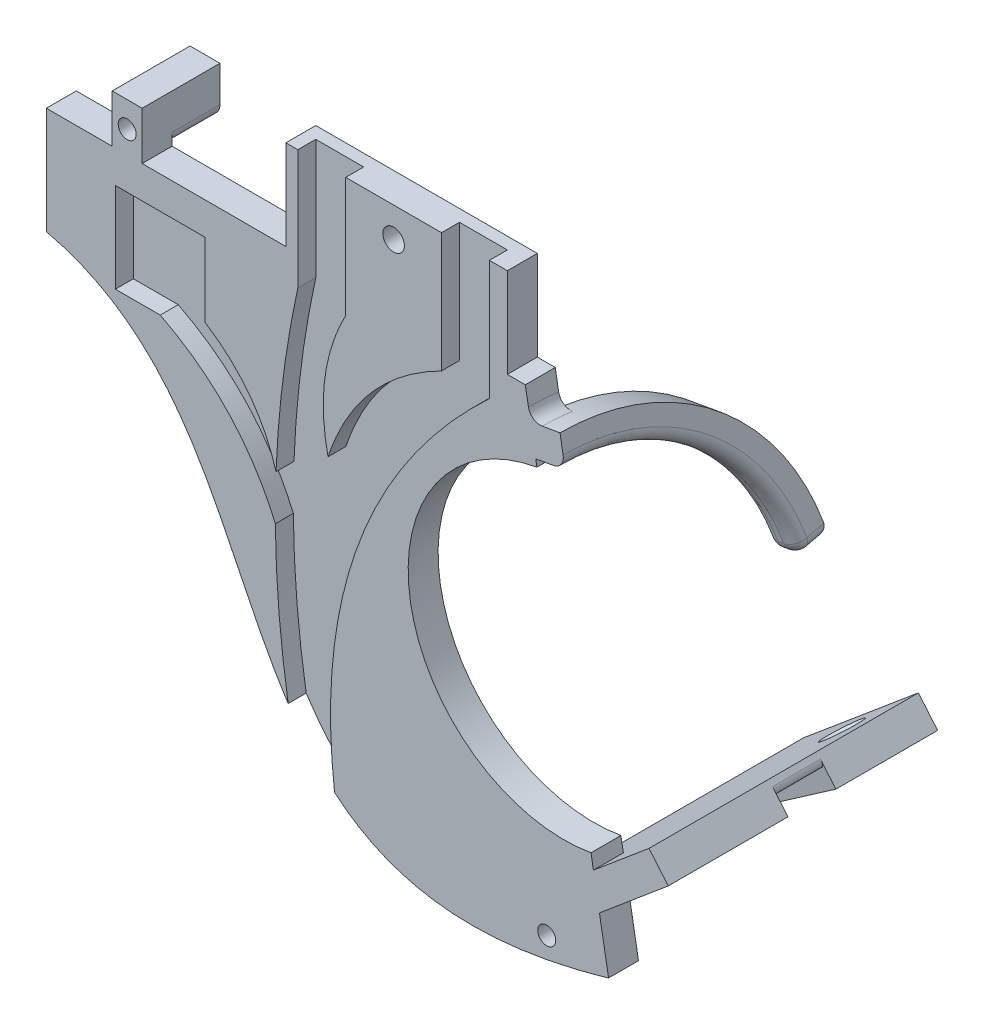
ISO-10303-21;
HEADER;
FILE_DESCRIPTION(('STEP AP214'),'2;1');
FILE_NAME('part.step','',(''),(''),'','','');
FILE_SCHEMA(('AUTOMOTIVE_DESIGN { 1 0 10303 214 1 1 1 1 }'));
ENDSEC;
DATA;
#1=APPLICATION_CONTEXT('core data for automotive mechanical design processes');
#2=APPLICATION_PROTOCOL_DEFINITION('international standard','automotive_design',2000,#1);
#3=PRODUCT_CONTEXT('',#1,'mechanical');
#4=PRODUCT('Part','Part','',(#3));
#5=PRODUCT_RELATED_PRODUCT_CATEGORY('part','',(#4));
#6=PRODUCT_DEFINITION_FORMATION('','',#4);
#7=PRODUCT_DEFINITION_CONTEXT('part definition',#1,'design');
#8=PRODUCT_DEFINITION('design','',#6,#7);
#9=PRODUCT_DEFINITION_SHAPE('','',#8);
#10=(LENGTH_UNIT() NAMED_UNIT(*) SI_UNIT(.MILLI.,.METRE.));
#11=(NAMED_UNIT(*) PLANE_ANGLE_UNIT() SI_UNIT($,.RADIAN.));
#12=(NAMED_UNIT(*) SI_UNIT($,.STERADIAN.) SOLID_ANGLE_UNIT());
#13=UNCERTAINTY_MEASURE_WITH_UNIT(LENGTH_MEASURE(1.E-05),#10,'distance_accuracy_value','');
#14=(GEOMETRIC_REPRESENTATION_CONTEXT(3) GLOBAL_UNCERTAINTY_ASSIGNED_CONTEXT((#13)) GLOBAL_UNIT_ASSIGNED_CONTEXT((#10,
#11,#12)) REPRESENTATION_CONTEXT('',''));
#15=CARTESIAN_POINT('',(0.,0.,0.));
#16=DIRECTION('',(0.,0.,1.));
#17=DIRECTION('',(1.,0.,0.));
#18=AXIS2_PLACEMENT_3D('',#15,#16,#17);
#19=CARTESIAN_POINT('',(0.,0.,0.));
#20=DIRECTION('',(0.,0.,1.));
#21=DIRECTION('',(1.,0.,0.));
#22=AXIS2_PLACEMENT_3D('',#19,#20,#21);
#23=PLANE('',#22);
#24=CARTESIAN_POINT('',(83.5742083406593,-77.858047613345,0.));
#25=DIRECTION('',(0.,0.,1.));
#26=DIRECTION('',(1.,0.,0.));
#27=AXIS2_PLACEMENT_3D('',#24,#25,#26);
#28=CIRCLE('',#27,1.5);
#29=CARTESIAN_POINT('',(85.0742083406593,-77.858047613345,0.));
#30=VERTEX_POINT('',#29);
#31=EDGE_CURVE('E447',#30,#30,#28,.T.);
#32=ORIENTED_EDGE('',*,*,#31,.T.);
#33=EDGE_LOOP('',(#32));
#34=FACE_BOUND('',#33,.T.);
#35=CARTESIAN_POINT('',(58.,10.,0.));
#36=DIRECTION('',(0.,0.,-1.));
#37=DIRECTION('',(-1.,0.,0.));
#38=AXIS2_PLACEMENT_3D('',#35,#36,#37);
#39=CIRCLE('',#38,3.15);
#40=CARTESIAN_POINT('',(54.85,10.,0.));
#41=VERTEX_POINT('',#40);
#42=EDGE_CURVE('E444',#41,#41,#39,.T.);
#43=ORIENTED_EDGE('',*,*,#42,.F.);
#44=EDGE_LOOP('',(#43));
#45=FACE_BOUND('',#44,.T.);
#46=DIRECTION('',(-1.,0.,0.));
#47=VECTOR('',#46,1.);
#48=CARTESIAN_POINT('',(11.,0.,0.));
#49=LINE('',#48,#47);
#50=CARTESIAN_POINT('',(14.,0.,0.));
#51=VERTEX_POINT('',#50);
#52=CARTESIAN_POINT('',(13.,0.,0.));
#53=VERTEX_POINT('',#52);
#54=EDGE_CURVE('E422',#51,#53,#49,.T.);
#55=ORIENTED_EDGE('',*,*,#54,.F.);
#56=CARTESIAN_POINT('',(14.,2.,0.));
#57=DIRECTION('',(0.,0.,1.));
#58=DIRECTION('',(1.,0.,0.));
#59=AXIS2_PLACEMENT_3D('',#56,#57,#58);
#60=CIRCLE('',#59,2.);
#61=CARTESIAN_POINT('',(16.,2.,0.));
#62=VERTEX_POINT('',#61);
#63=EDGE_CURVE('E1073',#51,#62,#60,.T.);
#64=ORIENTED_EDGE('',*,*,#63,.T.);
#65=DIRECTION('',(0.,1.,0.));
#66=VECTOR('',#65,1.);
#67=CARTESIAN_POINT('',(16.,0.,0.));
#68=LINE('',#67,#66);
#69=CARTESIAN_POINT('',(16.,0.,0.));
#70=VERTEX_POINT('',#69);
#71=EDGE_CURVE('E1063',#70,#62,#68,.T.);
#72=ORIENTED_EDGE('',*,*,#71,.F.);
#73=DIRECTION('',(-1.,0.,0.));
#74=VECTOR('',#73,1.);
#75=CARTESIAN_POINT('',(16.,0.,0.));
#76=LINE('',#75,#74);
#77=CARTESIAN_POINT('',(40.,0.,0.));
#78=VERTEX_POINT('',#77);
#79=EDGE_CURVE('E916',#78,#70,#76,.T.);
#80=ORIENTED_EDGE('',*,*,#79,.F.);
#81=DIRECTION('',(0.,-1.,0.));
#82=VECTOR('',#81,1.);
#83=CARTESIAN_POINT('',(40.,0.,0.));
#84=LINE('',#83,#82);
#85=CARTESIAN_POINT('',(40.,15.,0.));
#86=VERTEX_POINT('',#85);
#87=EDGE_CURVE('E914',#86,#78,#84,.T.);
#88=ORIENTED_EDGE('',*,*,#87,.F.);
#89=DIRECTION('',(-1.,0.,0.));
#90=VECTOR('',#89,1.);
#91=CARTESIAN_POINT('',(55.,15.,0.));
#92=LINE('',#91,#90);
#93=CARTESIAN_POINT('',(77.,15.,0.));
#94=VERTEX_POINT('',#93);
#95=EDGE_CURVE('E912',#94,#86,#92,.T.);
#96=ORIENTED_EDGE('',*,*,#95,.F.);
#97=DIRECTION('',(0.,1.,0.));
#98=VECTOR('',#97,1.);
#99=CARTESIAN_POINT('',(77.,0.,0.));
#100=LINE('',#99,#98);
#101=CARTESIAN_POINT('',(77.,0.,0.));
#102=VERTEX_POINT('',#101);
#103=EDGE_CURVE('E909',#102,#94,#100,.T.);
#104=ORIENTED_EDGE('',*,*,#103,.F.);
#105=DIRECTION('',(-1.,0.,0.));
#106=VECTOR('',#105,1.);
#107=CARTESIAN_POINT('',(77.,0.,0.));
#108=LINE('',#107,#106);
#109=CARTESIAN_POINT('',(80.,0.,0.));
#110=VERTEX_POINT('',#109);
#111=EDGE_CURVE('E905',#110,#102,#108,.T.);
#112=ORIENTED_EDGE('',*,*,#111,.F.);
#113=DIRECTION('',(-0.173648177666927,0.984807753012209,0.));
#114=VECTOR('',#113,1.);
#115=CARTESIAN_POINT('',(80.,0.,0.));
#116=LINE('',#115,#114);
#117=CARTESIAN_POINT('',(80.5728099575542,-3.24856669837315,0.));
#118=VERTEX_POINT('',#117);
#119=EDGE_CURVE('E901',#118,#110,#116,.T.);
#120=ORIENTED_EDGE('',*,*,#119,.F.);
#121=CARTESIAN_POINT('',(80.5728099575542,-3.24856669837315,0.));
#122=CARTESIAN_POINT('',(80.5827076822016,-3.3046960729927,0.));
#123=CARTESIAN_POINT('',(80.5949663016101,-3.36038146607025,0.));
#124=CARTESIAN_POINT('',(80.6241210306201,-3.47052244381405,0.));
#125=CARTESIAN_POINT('',(80.6410169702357,-3.52497807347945,0.));
#126=CARTESIAN_POINT('',(80.6984798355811,-3.68583739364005,0.));
#127=CARTESIAN_POINT('',(80.7458511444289,-3.789898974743,0.));
#128=CARTESIAN_POINT('',(80.8574011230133,-3.98859237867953,0.));
#129=CARTESIAN_POINT('',(80.9215887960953,-4.08321911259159,0.));
#130=CARTESIAN_POINT('',(81.0649762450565,-4.26030799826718,0.));
#131=CARTESIAN_POINT('',(81.144172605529,-4.34277291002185,0.));
#132=CARTESIAN_POINT('',(81.3151044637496,-4.49291123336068,0.));
#133=CARTESIAN_POINT('',(81.4068019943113,-4.56062787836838,0.));
#134=CARTESIAN_POINT('',(81.6003536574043,-4.67959315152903,0.));
#135=CARTESIAN_POINT('',(81.7022096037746,-4.73083883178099,0.));
#136=CARTESIAN_POINT('',(81.9124125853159,-4.81500597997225,0.));
#137=CARTESIAN_POINT('',(82.0207105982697,-4.84805006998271,0.));
#138=CARTESIAN_POINT('',(82.2413064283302,-4.89531923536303,0.));
#139=CARTESIAN_POINT('',(82.3536013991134,-4.90955743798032,0.));
#140=CARTESIAN_POINT('',(82.5375393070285,-4.91711592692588,0.));
#141=CARTESIAN_POINT('',(82.6089944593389,-4.91619088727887,0.));
#142=CARTESIAN_POINT('',(82.7512899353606,-4.90667423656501,0.));
#143=CARTESIAN_POINT('',(82.8221309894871,-4.89809354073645,0.));
#144=CARTESIAN_POINT('',(82.8923350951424,-4.88570647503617,0.));
#145=B_SPLINE_CURVE_WITH_KNOTS('',3,(#121,#122,#123,#124,#125,#126,#127,#128,#129,#130,#131,
#132,#133,#134,#135,#136,#137,#138,#139,#140,#141,#142,#143,#144),.UNSPECIFIED.,.F.,.F.,(4,2,2,
2,2,2,2,2,2,2,2,4),(0.,0.170881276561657,0.341756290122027,0.683008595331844,1.02444397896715,
1.36580175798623,1.70614498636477,2.04654909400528,2.38463097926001,2.72247674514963,
2.93647737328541,3.15017337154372),.UNSPECIFIED.);
#146=CARTESIAN_POINT('',(82.8923350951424,-4.88570647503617,0.));
#147=VERTEX_POINT('',#146);
#148=EDGE_CURVE('E1048',#118,#147,#145,.T.);
#149=ORIENTED_EDGE('',*,*,#148,.T.);
#150=DIRECTION('',(-0.984807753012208,-0.173648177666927,0.));
#151=VECTOR('',#150,1.);
#152=CARTESIAN_POINT('',(80.922719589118,-5.23300283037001,0.));
#153=LINE('',#152,#151);
#154=CARTESIAN_POINT('',(80.922719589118,-5.23300283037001,0.));
#155=VERTEX_POINT('',#154);
#156=EDGE_CURVE('E1019',#155,#147,#153,.F.);
#157=ORIENTED_EDGE('',*,*,#156,.F.);
#158=CARTESIAN_POINT('',(81.448120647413,-8.21270030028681,0.));
#159=VERTEX_POINT('',#158);
#160=EDGE_CURVE('E1269',#159,#155,#116,.T.);
#161=ORIENTED_EDGE('',*,*,#160,.F.);
#162=CARTESIAN_POINT('',(81.4481206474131,-8.2127003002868,0.));
#163=CARTESIAN_POINT('',(81.4580564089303,-8.26904502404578,0.));
#164=CARTESIAN_POINT('',(81.4703612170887,-8.3249442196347,0.));
#165=CARTESIAN_POINT('',(81.499624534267,-8.43550881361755,0.));
#166=CARTESIAN_POINT('',(81.5165828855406,-8.49017425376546,0.));
#167=CARTESIAN_POINT('',(81.5742589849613,-8.65166052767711,0.));
#168=CARTESIAN_POINT('',(81.6218061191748,-8.75613116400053,0.));
#169=CARTESIAN_POINT('',(81.7337767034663,-8.95560815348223,0.));
#170=CARTESIAN_POINT('',(81.7982094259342,-9.05060926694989,0.));
#171=CARTESIAN_POINT('',(81.9421583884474,-9.22838822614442,0.));
#172=CARTESIAN_POINT('',(82.0216709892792,-9.3111690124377,0.));
#173=CARTESIAN_POINT('',(82.1932336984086,-9.46178848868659,0.));
#174=CARTESIAN_POINT('',(82.2852349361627,-9.52968285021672,0.));
#175=CARTESIAN_POINT('',(82.4794403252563,-9.6489113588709,0.));
#176=CARTESIAN_POINT('',(82.5816462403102,-9.70024263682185,0.));
#177=CARTESIAN_POINT('',(82.7923529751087,-9.7843675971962,0.));
#178=CARTESIAN_POINT('',(82.9007894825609,-9.81732261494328,0.));
#179=CARTESIAN_POINT('',(83.1216493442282,-9.86434601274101,0.));
#180=CARTESIAN_POINT('',(83.2340697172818,-9.87842822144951,0.));
#181=CARTESIAN_POINT('',(83.4173733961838,-9.88563733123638,0.));
#182=CARTESIAN_POINT('',(83.4880766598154,-9.88462930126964,0.));
#183=CARTESIAN_POINT('',(83.6288723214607,-9.87508940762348,0.));
#184=CARTESIAN_POINT('',(83.6989654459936,-9.86656826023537,0.));
#185=CARTESIAN_POINT('',(83.7684341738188,-9.85431125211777,0.));
#186=B_SPLINE_CURVE_WITH_KNOTS('',3,(#162,#163,#164,#165,#166,#167,#168,#169,#170,#171,#172,
#173,#174,#175,#176,#177,#178,#179,#180,#181,#182,#183,#184,#185),.UNSPECIFIED.,.F.,.F.,(4,2,2,
2,2,2,2,2,2,2,2,4),(0.,0.171536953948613,0.343068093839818,0.685649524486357,1.02841947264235,
1.37110680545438,1.71248984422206,2.05393198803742,2.39232722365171,2.73047437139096,
2.9422340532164,3.15369218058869),.UNSPECIFIED.);
#187=CARTESIAN_POINT('',(83.7684341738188,-9.85431125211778,0.));
#188=VERTEX_POINT('',#187);
#189=EDGE_CURVE('E1012',#159,#188,#186,.T.);
#190=ORIENTED_EDGE('',*,*,#189,.T.);
#191=DIRECTION('',(-0.984807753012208,-0.173648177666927,0.));
#192=VECTOR('',#191,1.);
#193=CARTESIAN_POINT('',(81.7988186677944,-10.2016076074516,0.));
#194=LINE('',#193,#192);
#195=CARTESIAN_POINT('',(81.7988186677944,-10.2016076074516,0.));
#196=VERTEX_POINT('',#195);
#197=EDGE_CURVE('E1001',#196,#188,#194,.F.);
#198=ORIENTED_EDGE('',*,*,#197,.F.);
#199=CARTESIAN_POINT('',(81.933017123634,-10.9626848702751,0.));
#200=VERTEX_POINT('',#199);
#201=EDGE_CURVE('E907',#200,#196,#116,.T.);
#202=ORIENTED_EDGE('',*,*,#201,.F.);
#203=CARTESIAN_POINT('',(86.4512955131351,-36.5871149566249,0.));
#204=DIRECTION('',(0.,0.,-1.));
#205=DIRECTION('',(1.,0.,0.));
#206=AXIS2_PLACEMENT_3D('',#203,#204,#205);
#207=CIRCLE('',#206,26.0197282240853);
#208=CARTESIAN_POINT('',(90.9695739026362,-62.2115450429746,0.));
#209=VERTEX_POINT('',#208);
#210=EDGE_CURVE('E515',#209,#200,#207,.T.);
#211=ORIENTED_EDGE('',*,*,#210,.F.);
#212=CARTESIAN_POINT('',(91.3765611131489,-64.519684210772,0.));
#213=VERTEX_POINT('',#212);
#214=EDGE_CURVE('E906',#213,#209,#116,.T.);
#215=ORIENTED_EDGE('',*,*,#214,.F.);
#216=DIRECTION('',(-0.766044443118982,-0.642787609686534,0.));
#217=VECTOR('',#216,1.);
#218=CARTESIAN_POINT('',(69.524336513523,-82.8558778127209,0.));
#219=LINE('',#218,#217);
#220=CARTESIAN_POINT('',(81.4626507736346,-72.838442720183,0.));
#221=VERTEX_POINT('',#220);
#222=EDGE_CURVE('E948',#213,#221,#219,.T.);
#223=ORIENTED_EDGE('',*,*,#222,.T.);
#224=DIRECTION('',(0.642787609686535,-0.766044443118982,0.));
#225=VECTOR('',#224,1.);
#226=CARTESIAN_POINT('',(11.9383142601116,10.0174350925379,0.));
#227=LINE('',#226,#225);
#228=CARTESIAN_POINT('',(84.6765888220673,-76.6686649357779,0.));
#229=VERTEX_POINT('',#228);
#230=EDGE_CURVE('E945',#221,#229,#227,.T.);
#231=ORIENTED_EDGE('',*,*,#230,.T.);
#232=DIRECTION('',(0.766044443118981,0.642787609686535,0.));
#233=VECTOR('',#232,1.);
#234=CARTESIAN_POINT('',(72.7382745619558,-86.6861000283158,0.));
#235=LINE('',#234,#233);
#236=CARTESIAN_POINT('',(92.3791193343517,-70.2054744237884,0.));
#237=VERTEX_POINT('',#236);
#238=EDGE_CURVE('E942',#229,#237,#235,.T.);
#239=ORIENTED_EDGE('',*,*,#238,.T.);
#240=CARTESIAN_POINT('',(93.9048014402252,-78.858047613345,0.));
#241=VERTEX_POINT('',#240);
#242=EDGE_CURVE('E902',#241,#237,#116,.T.);
#243=ORIENTED_EDGE('',*,*,#242,.F.);
#244=CARTESIAN_POINT('',(0.,-17.8447631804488,0.));
#245=CARTESIAN_POINT('',(44.322722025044,-28.262472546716,0.));
#246=CARTESIAN_POINT('',(22.7748633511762,-99.6736268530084,0.));
#247=CARTESIAN_POINT('',(93.9048014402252,-78.858047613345,0.));
#248=B_SPLINE_CURVE_WITH_KNOTS('',3,(#244,#245,#246,#247),.UNSPECIFIED.,.F.,.F.,(4,4),(0.,1.),.UNSPECIFIED.);
#249=CARTESIAN_POINT('',(0.,-17.8447631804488,0.));
#250=VERTEX_POINT('',#249);
#251=EDGE_CURVE('E622',#250,#241,#248,.T.);
#252=ORIENTED_EDGE('',*,*,#251,.F.);
#253=DIRECTION('',(0.,-1.,0.));
#254=VECTOR('',#253,1.);
#255=CARTESIAN_POINT('',(0.,0.,0.));
#256=LINE('',#255,#254);
#257=CARTESIAN_POINT('',(0.,0.,0.));
#258=VERTEX_POINT('',#257);
#259=EDGE_CURVE('E872',#258,#250,#256,.T.);
#260=ORIENTED_EDGE('',*,*,#259,.F.);
#261=DIRECTION('',(-1.,0.,0.));
#262=VECTOR('',#261,1.);
#263=CARTESIAN_POINT('',(0.,0.,0.));
#264=LINE('',#263,#262);
#265=CARTESIAN_POINT('',(11.,0.,0.));
#266=VERTEX_POINT('',#265);
#267=EDGE_CURVE('E875',#266,#258,#264,.T.);
#268=ORIENTED_EDGE('',*,*,#267,.F.);
#269=DIRECTION('',(0.,-1.,0.));
#270=VECTOR('',#269,1.);
#271=CARTESIAN_POINT('',(11.,0.,0.));
#272=LINE('',#271,#270);
#273=CARTESIAN_POINT('',(11.,2.,0.));
#274=VERTEX_POINT('',#273);
#275=EDGE_CURVE('E1069',#274,#266,#272,.T.);
#276=ORIENTED_EDGE('',*,*,#275,.F.);
#277=CARTESIAN_POINT('',(13.,2.,0.));
#278=DIRECTION('',(0.,0.,1.));
#279=DIRECTION('',(1.,0.,0.));
#280=AXIS2_PLACEMENT_3D('',#277,#278,#279);
#281=CIRCLE('',#280,2.);
#282=EDGE_CURVE('E1075',#274,#53,#281,.T.);
#283=ORIENTED_EDGE('',*,*,#282,.T.);
#284=EDGE_LOOP('',(#55,#64,#72,#80,#88,#96,#104,#112,#120,#149,#157,#161,#190,#198,#202,#211,
#215,#223,#231,#239,#243,#252,#260,#268,#276,#283));
#285=FACE_BOUND('',#284,.T.);
#286=ADVANCED_FACE('F38',(#34,#45,#285),#23,.F.);
#287=CARTESIAN_POINT('',(81.4626507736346,-72.838442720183,-40.));
#288=DIRECTION('',(-0.766044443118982,-0.642787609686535,0.));
#289=DIRECTION('',(0.642787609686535,-0.766044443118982,0.));
#290=AXIS2_PLACEMENT_3D('',#287,#288,#289);
#291=PLANE('',#290);
#292=DIRECTION('',(0.,0.,1.));
#293=VECTOR('',#292,1.);
#294=CARTESIAN_POINT('',(82.7482259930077,-74.370531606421,-40.));
#295=LINE('',#294,#293);
#296=CARTESIAN_POINT('',(82.7482259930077,-74.370531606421,-32.1192521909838));
#297=VERTEX_POINT('',#296);
#298=CARTESIAN_POINT('',(82.7482259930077,-74.370531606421,-24.119252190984));
#299=VERTEX_POINT('',#298);
#300=EDGE_CURVE('E464',#297,#299,#295,.T.);
#301=ORIENTED_EDGE('',*,*,#300,.T.);
#302=DIRECTION('',(0.642787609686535,-0.766044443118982,0.));
#303=VECTOR('',#302,1.);
#304=CARTESIAN_POINT('',(81.4626507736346,-72.838442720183,-24.119252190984));
#305=LINE('',#304,#303);
#306=CARTESIAN_POINT('',(84.6765888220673,-76.6686649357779,-24.119252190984));
#307=VERTEX_POINT('',#306);
#308=EDGE_CURVE('E473',#299,#307,#305,.T.);
#309=ORIENTED_EDGE('',*,*,#308,.T.);
#310=DIRECTION('',(0.,0.,1.));
#311=VECTOR('',#310,1.);
#312=CARTESIAN_POINT('',(84.6765888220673,-76.6686649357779,-40.));
#313=LINE('',#312,#311);
#314=EDGE_CURVE('E501',#307,#229,#313,.T.);
#315=ORIENTED_EDGE('',*,*,#314,.T.);
#316=ORIENTED_EDGE('',*,*,#230,.F.);
#317=DIRECTION('',(0.,0.,1.));
#318=VECTOR('',#317,1.);
#319=CARTESIAN_POINT('',(81.4626507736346,-72.838442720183,-40.));
#320=LINE('',#319,#318);
#321=CARTESIAN_POINT('',(81.4626507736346,-72.838442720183,-40.));
#322=VERTEX_POINT('',#321);
#323=EDGE_CURVE('E502',#322,#221,#320,.T.);
#324=ORIENTED_EDGE('',*,*,#323,.F.);
#325=DIRECTION('',(0.642787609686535,-0.766044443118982,0.));
#326=VECTOR('',#325,1.);
#327=CARTESIAN_POINT('',(81.4626507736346,-72.838442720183,-40.));
#328=LINE('',#327,#326);
#329=CARTESIAN_POINT('',(84.6765888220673,-76.6686649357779,-40.));
#330=VERTEX_POINT('',#329);
#331=EDGE_CURVE('E486',#322,#330,#328,.T.);
#332=ORIENTED_EDGE('',*,*,#331,.T.);
#333=CARTESIAN_POINT('',(84.6765888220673,-76.6686649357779,-32.1192521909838));
#334=VERTEX_POINT('',#333);
#335=EDGE_CURVE('E497',#330,#334,#313,.T.);
#336=ORIENTED_EDGE('',*,*,#335,.T.);
#337=DIRECTION('',(-0.642787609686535,0.766044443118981,0.));
#338=VECTOR('',#337,1.);
#339=CARTESIAN_POINT('',(86.6049516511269,-78.9667982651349,-32.1192521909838));
#340=LINE('',#339,#338);
#341=EDGE_CURVE('E461',#334,#297,#340,.T.);
#342=ORIENTED_EDGE('',*,*,#341,.T.);
#343=EDGE_LOOP('',(#301,#309,#315,#316,#324,#332,#336,#342));
#344=FACE_BOUND('',#343,.T.);
#345=ADVANCED_FACE('F1101',(#344),#291,.T.);
#346=CARTESIAN_POINT('',(92.3791193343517,-70.2054744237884,-40.));
#347=DIRECTION('',(0.642787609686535,-0.766044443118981,0.));
#348=DIRECTION('',(0.766044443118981,0.642787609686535,0.));
#349=AXIS2_PLACEMENT_3D('',#346,#347,#348);
#350=PLANE('',#349);
#351=ORIENTED_EDGE('',*,*,#314,.F.);
#352=DIRECTION('',(0.719846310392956,0.604022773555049,0.342020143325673));
#353=VECTOR('',#352,1.);
#354=CARTESIAN_POINT('',(87.5682235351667,-74.2422953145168,-22.7453515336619));
#355=LINE('',#354,#353);
#356=CARTESIAN_POINT('',(103.869785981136,-60.5636602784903,-15.));
#357=VERTEX_POINT('',#356);
#358=EDGE_CURVE('E470',#307,#357,#355,.T.);
#359=ORIENTED_EDGE('',*,*,#358,.T.);
#360=DIRECTION('',(0.,0.,1.));
#361=VECTOR('',#360,1.);
#362=CARTESIAN_POINT('',(103.869785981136,-60.5636602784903,-40.));
#363=LINE('',#362,#361);
#364=CARTESIAN_POINT('',(103.869785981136,-60.5636602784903,5.));
#365=VERTEX_POINT('',#364);
#366=EDGE_CURVE('E489',#357,#365,#363,.T.);
#367=ORIENTED_EDGE('',*,*,#366,.T.);
#368=DIRECTION('',(0.766044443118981,0.642787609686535,0.));
#369=VECTOR('',#368,1.);
#370=CARTESIAN_POINT('',(92.3791193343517,-70.2054744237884,5.));
#371=LINE('',#370,#369);
#372=CARTESIAN_POINT('',(92.3791193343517,-70.2054744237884,5.));
#373=VERTEX_POINT('',#372);
#374=EDGE_CURVE('E476',#373,#365,#371,.T.);
#375=ORIENTED_EDGE('',*,*,#374,.F.);
#376=DIRECTION('',(0.,0.,1.));
#377=VECTOR('',#376,1.);
#378=CARTESIAN_POINT('',(92.3791193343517,-70.2054744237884,5.));
#379=LINE('',#378,#377);
#380=EDGE_CURVE('E500',#237,#373,#379,.T.);
#381=ORIENTED_EDGE('',*,*,#380,.F.);
#382=ORIENTED_EDGE('',*,*,#238,.F.);
#383=EDGE_LOOP('',(#351,#359,#367,#375,#381,#382));
#384=FACE_BOUND('',#383,.T.);
#385=ADVANCED_FACE('F1110',(#384),#350,.T.);
#386=CARTESIAN_POINT('',(97.5882215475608,-65.8345186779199,-33.5));
#387=DIRECTION('',(0.642787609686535,-0.766044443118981,0.));
#388=DIRECTION('',(0.766044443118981,0.642787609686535,0.));
#389=AXIS2_PLACEMENT_3D('',#386,#387,#388);
#390=CIRCLE('',#389,1.8);
#391=CARTESIAN_POINT('',(98.967101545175,-64.6775009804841,-33.5));
#392=VERTEX_POINT('',#391);
#393=EDGE_CURVE('E42',#392,#392,#390,.T.);
#394=ORIENTED_EDGE('',*,*,#393,.F.);
#395=EDGE_LOOP('',(#394));
#396=FACE_BOUND('',#395,.T.);
#397=CARTESIAN_POINT('',(103.869785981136,-60.5636602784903,-40.));
#398=VERTEX_POINT('',#397);
#399=CARTESIAN_POINT('',(103.869785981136,-60.5636602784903,-23.));
#400=VERTEX_POINT('',#399);
#401=EDGE_CURVE('E507',#398,#400,#363,.T.);
#402=ORIENTED_EDGE('',*,*,#401,.T.);
#403=DIRECTION('',(-0.719846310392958,-0.604022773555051,-0.342020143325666));
#404=VECTOR('',#403,1.);
#405=CARTESIAN_POINT('',(89.5378390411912,-72.5895916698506,-29.8095293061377));
#406=LINE('',#405,#404);
#407=EDGE_CURVE('E467',#400,#334,#406,.T.);
#408=ORIENTED_EDGE('',*,*,#407,.T.);
#409=ORIENTED_EDGE('',*,*,#335,.F.);
#410=DIRECTION('',(0.766044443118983,0.642787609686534,0.));
#411=VECTOR('',#410,1.);
#412=CARTESIAN_POINT('',(84.6765888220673,-76.6686649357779,-40.));
#413=LINE('',#412,#411);
#414=EDGE_CURVE('E477',#330,#398,#413,.T.);
#415=ORIENTED_EDGE('',*,*,#414,.T.);
#416=EDGE_LOOP('',(#402,#408,#409,#415));
#417=FACE_BOUND('',#416,.T.);
#418=ADVANCED_FACE('F1094',(#396,#417),#350,.T.);
#419=CARTESIAN_POINT('',(103.869785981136,-60.5636602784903,-40.));
#420=DIRECTION('',(0.766044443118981,0.642787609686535,0.));
#421=DIRECTION('',(-0.642787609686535,0.766044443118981,0.));
#422=AXIS2_PLACEMENT_3D('',#419,#420,#421);
#423=PLANE('',#422);
#424=DIRECTION('',(-0.642787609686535,0.766044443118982,0.));
#425=VECTOR('',#424,1.);
#426=CARTESIAN_POINT('',(103.869785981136,-60.5636602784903,-15.));
#427=LINE('',#426,#425);
#428=CARTESIAN_POINT('',(101.29863554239,-57.4994825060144,-15.));
#429=VERTEX_POINT('',#428);
#430=EDGE_CURVE('E54',#357,#429,#427,.T.);
#431=ORIENTED_EDGE('',*,*,#430,.T.);
#432=DIRECTION('',(0.,0.,1.));
#433=VECTOR('',#432,1.);
#434=CARTESIAN_POINT('',(101.29863554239,-57.4994825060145,-40.));
#435=LINE('',#434,#433);
#436=CARTESIAN_POINT('',(101.29863554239,-57.4994825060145,-23.));
#437=VERTEX_POINT('',#436);
#438=EDGE_CURVE('E1080',#429,#437,#435,.F.);
#439=ORIENTED_EDGE('',*,*,#438,.T.);
#440=DIRECTION('',(0.642787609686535,-0.766044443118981,0.));
#441=VECTOR('',#440,1.);
#442=CARTESIAN_POINT('',(103.869785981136,-60.5636602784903,-23.));
#443=LINE('',#442,#441);
#444=EDGE_CURVE('E61',#437,#400,#443,.T.);
#445=ORIENTED_EDGE('',*,*,#444,.T.);
#446=ORIENTED_EDGE('',*,*,#401,.F.);
#447=DIRECTION('',(-0.642787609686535,0.766044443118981,0.));
#448=VECTOR('',#447,1.);
#449=CARTESIAN_POINT('',(103.869785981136,-60.5636602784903,-40.));
#450=LINE('',#449,#448);
#451=CARTESIAN_POINT('',(100.655847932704,-56.7334380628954,-40.));
#452=VERTEX_POINT('',#451);
#453=EDGE_CURVE('E479',#398,#452,#450,.T.);
#454=ORIENTED_EDGE('',*,*,#453,.T.);
#455=DIRECTION('',(0.,0.,1.));
#456=VECTOR('',#455,1.);
#457=CARTESIAN_POINT('',(100.655847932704,-56.7334380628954,-40.));
#458=LINE('',#457,#456);
#459=CARTESIAN_POINT('',(100.655847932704,-56.7334380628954,5.));
#460=VERTEX_POINT('',#459);
#461=EDGE_CURVE('E505',#452,#460,#458,.T.);
#462=ORIENTED_EDGE('',*,*,#461,.T.);
#463=DIRECTION('',(-0.642787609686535,0.766044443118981,0.));
#464=VECTOR('',#463,1.);
#465=CARTESIAN_POINT('',(103.869785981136,-60.5636602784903,5.));
#466=LINE('',#465,#464);
#467=EDGE_CURVE('E492',#365,#460,#466,.T.);
#468=ORIENTED_EDGE('',*,*,#467,.F.);
#469=ORIENTED_EDGE('',*,*,#366,.F.);
#470=EDGE_LOOP('',(#431,#439,#445,#446,#454,#462,#468,#469));
#471=FACE_BOUND('',#470,.T.);
#472=ADVANCED_FACE('F1090',(#471),#423,.T.);
#473=CARTESIAN_POINT('',(80.,0.,5.));
#474=DIRECTION('',(-0.984807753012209,-0.173648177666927,0.));
#475=DIRECTION('',(0.173648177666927,-0.984807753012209,0.));
#476=AXIS2_PLACEMENT_3D('',#473,#474,#475);
#477=PLANE('',#476);
#478=DIRECTION('',(-0.173648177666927,0.984807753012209,0.));
#479=VECTOR('',#478,1.);
#480=CARTESIAN_POINT('',(80.,0.,5.));
#481=LINE('',#480,#479);
#482=CARTESIAN_POINT('',(91.3765611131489,-64.5196842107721,5.));
#483=VERTEX_POINT('',#482);
#484=CARTESIAN_POINT('',(90.9695739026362,-62.2115450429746,5.));
#485=VERTEX_POINT('',#484);
#486=EDGE_CURVE('E879',#483,#485,#481,.T.);
#487=ORIENTED_EDGE('',*,*,#486,.F.);
#488=DIRECTION('',(0.,0.,-1.));
#489=VECTOR('',#488,1.);
#490=CARTESIAN_POINT('',(91.3765611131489,-64.5196842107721,5.));
#491=LINE('',#490,#489);
#492=EDGE_CURVE('E512',#483,#213,#491,.T.);
#493=ORIENTED_EDGE('',*,*,#492,.T.);
#494=ORIENTED_EDGE('',*,*,#214,.T.);
#495=DIRECTION('',(0.,0.,-1.));
#496=VECTOR('',#495,1.);
#497=CARTESIAN_POINT('',(90.9695739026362,-62.2115450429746,5.));
#498=LINE('',#497,#496);
#499=EDGE_CURVE('E521',#485,#209,#498,.T.);
#500=ORIENTED_EDGE('',*,*,#499,.F.);
#501=EDGE_LOOP('',(#487,#493,#494,#500));
#502=FACE_BOUND('',#501,.T.);
#503=ADVANCED_FACE('F1296',(#502),#477,.F.);
#504=CARTESIAN_POINT('',(81.933017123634,-10.9626848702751,5.));
#505=VERTEX_POINT('',#504);
#506=CARTESIAN_POINT('',(81.7364817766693,-9.84807753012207,5.));
#507=VERTEX_POINT('',#506);
#508=EDGE_CURVE('E880',#505,#507,#481,.T.);
#509=ORIENTED_EDGE('',*,*,#508,.F.);
#510=DIRECTION('',(0.,0.,-1.));
#511=VECTOR('',#510,1.);
#512=CARTESIAN_POINT('',(81.933017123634,-10.9626848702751,5.));
#513=LINE('',#512,#511);
#514=EDGE_CURVE('E519',#505,#200,#513,.T.);
#515=ORIENTED_EDGE('',*,*,#514,.T.);
#516=ORIENTED_EDGE('',*,*,#201,.T.);
#517=CARTESIAN_POINT('',(87.8141679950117,-44.3163488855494,5.));
#518=DIRECTION('',(-0.984807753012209,-0.173648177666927,0.));
#519=DIRECTION('',(-0.173648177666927,0.984807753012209,0.));
#520=AXIS2_PLACEMENT_3D('',#517,#518,#519);
#521=CIRCLE('',#520,35.);
#522=EDGE_CURVE('E860',#507,#196,#521,.T.);
#523=ORIENTED_EDGE('',*,*,#522,.F.);
#524=EDGE_LOOP('',(#509,#515,#516,#523));
#525=FACE_BOUND('',#524,.T.);
#526=ADVANCED_FACE('F1204',(#525),#477,.F.);
#527=CARTESIAN_POINT('',(42.,-5.,2.));
#528=CARTESIAN_POINT('',(35.4028477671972,-35.2062145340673,2.));
#529=CARTESIAN_POINT('',(40.3930420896,-65.909287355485,2.));
#530=B_SPLINE_CURVE_WITH_KNOTS('',2,(#527,#528,#529),.UNSPECIFIED.,.F.,.F.,(3,3),(0.,1.),.UNSPECIFIED.);
#531=DIRECTION('',(0.,0.,1.));
#532=VECTOR('',#531,1.);
#533=SURFACE_OF_LINEAR_EXTRUSION('',#530,#532);
#534=CARTESIAN_POINT('',(42.,-5.,5.));
#535=CARTESIAN_POINT('',(35.4028477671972,-35.2062145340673,5.));
#536=CARTESIAN_POINT('',(40.3930420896,-65.909287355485,5.));
#537=B_SPLINE_CURVE_WITH_KNOTS('',2,(#534,#535,#536),.UNSPECIFIED.,.F.,.F.,(3,3),(0.,1.),.UNSPECIFIED.);
#538=CARTESIAN_POINT('',(42.,-5.,5.));
#539=VERTEX_POINT('',#538);
#540=CARTESIAN_POINT('',(38.362591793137,-33.3917170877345,5.));
#541=VERTEX_POINT('',#540);
#542=EDGE_CURVE('E629',#539,#541,#537,.T.);
#543=ORIENTED_EDGE('',*,*,#542,.T.);
#544=DIRECTION('',(0.,0.,1.));
#545=VECTOR('',#544,1.);
#546=CARTESIAN_POINT('',(38.362591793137,-33.3917170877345,2.));
#547=LINE('',#546,#545);
#548=CARTESIAN_POINT('',(38.362591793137,-33.3917170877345,2.));
#549=VERTEX_POINT('',#548);
#550=EDGE_CURVE('E776',#549,#541,#547,.T.);
#551=ORIENTED_EDGE('',*,*,#550,.F.);
#552=CARTESIAN_POINT('',(42.,-5.,2.));
#553=VERTEX_POINT('',#552);
#554=EDGE_CURVE('E583',#553,#549,#530,.T.);
#555=ORIENTED_EDGE('',*,*,#554,.F.);
#556=DIRECTION('',(0.,0.,1.));
#557=VECTOR('',#556,1.);
#558=CARTESIAN_POINT('',(42.,-5.,2.));
#559=LINE('',#558,#557);
#560=EDGE_CURVE('E618',#553,#539,#559,.T.);
#561=ORIENTED_EDGE('',*,*,#560,.T.);
#562=EDGE_LOOP('',(#543,#551,#555,#561));
#563=FACE_BOUND('',#562,.T.);
#564=ADVANCED_FACE('F691',(#563),#533,.F.);
#565=CARTESIAN_POINT('',(0.,0.,5.));
#566=DIRECTION('',(0.,0.,1.));
#567=DIRECTION('',(1.,0.,0.));
#568=AXIS2_PLACEMENT_3D('',#565,#566,#567);
#569=PLANE('',#568);
#570=CARTESIAN_POINT('',(83.5742083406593,-77.858047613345,5.));
#571=DIRECTION('',(0.,0.,-1.));
#572=DIRECTION('',(-1.,0.,0.));
#573=AXIS2_PLACEMENT_3D('',#570,#571,#572);
#574=CIRCLE('',#573,1.5);
#575=CARTESIAN_POINT('',(82.0742083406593,-77.858047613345,5.));
#576=VERTEX_POINT('',#575);
#577=EDGE_CURVE('E989',#576,#576,#574,.T.);
#578=ORIENTED_EDGE('',*,*,#577,.T.);
#579=EDGE_LOOP('',(#578));
#580=FACE_BOUND('',#579,.T.);
#581=DIRECTION('',(-0.984807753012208,-0.173648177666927,0.));
#582=VECTOR('',#581,1.);
#583=CARTESIAN_POINT('',(86.6605205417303,-8.97983664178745,5.));
#584=LINE('',#583,#582);
#585=CARTESIAN_POINT('',(84.6909050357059,-9.3271329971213,5.));
#586=VERTEX_POINT('',#585);
#587=EDGE_CURVE('E863',#586,#507,#584,.T.);
#588=ORIENTED_EDGE('',*,*,#587,.F.);
#589=CARTESIAN_POINT('',(84.3436086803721,-7.35751749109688,5.));
#590=DIRECTION('',(0.,0.,1.));
#591=DIRECTION('',(1.,0.,0.));
#592=AXIS2_PLACEMENT_3D('',#589,#590,#591);
#593=CIRCLE('',#592,2.);
#594=CARTESIAN_POINT('',(86.3132241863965,-7.01022113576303,5.));
#595=VERTEX_POINT('',#594);
#596=EDGE_CURVE('E1010',#586,#595,#593,.T.);
#597=ORIENTED_EDGE('',*,*,#596,.T.);
#598=DIRECTION('',(0.173648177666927,-0.984807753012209,0.));
#599=VECTOR('',#598,1.);
#600=CARTESIAN_POINT('',(85.7922796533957,-4.05579787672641,5.));
#601=LINE('',#600,#599);
#602=CARTESIAN_POINT('',(85.7922796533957,-4.05579787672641,5.));
#603=VERTEX_POINT('',#602);
#604=EDGE_CURVE('E859',#603,#595,#601,.T.);
#605=ORIENTED_EDGE('',*,*,#604,.F.);
#606=DIRECTION('',(-0.984807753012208,-0.173648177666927,0.));
#607=VECTOR('',#606,1.);
#608=CARTESIAN_POINT('',(85.7922796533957,-4.05579787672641,5.));
#609=LINE('',#608,#607);
#610=CARTESIAN_POINT('',(82.8378563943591,-4.57674240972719,5.));
#611=VERTEX_POINT('',#610);
#612=EDGE_CURVE('E869',#603,#611,#609,.T.);
#613=ORIENTED_EDGE('',*,*,#612,.T.);
#614=CARTESIAN_POINT('',(82.4905600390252,-2.60712690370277,5.));
#615=DIRECTION('',(0.,0.,1.));
#616=DIRECTION('',(1.,0.,0.));
#617=AXIS2_PLACEMENT_3D('',#614,#615,#616);
#618=CIRCLE('',#617,2.);
#619=CARTESIAN_POINT('',(80.5209445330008,-2.95442325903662,5.));
#620=VERTEX_POINT('',#619);
#621=EDGE_CURVE('E1055',#611,#620,#618,.F.);
#622=ORIENTED_EDGE('',*,*,#621,.T.);
#623=CARTESIAN_POINT('',(80.,0.,5.));
#624=VERTEX_POINT('',#623);
#625=EDGE_CURVE('E874',#620,#624,#481,.T.);
#626=ORIENTED_EDGE('',*,*,#625,.T.);
#627=DIRECTION('',(-1.,0.,0.));
#628=VECTOR('',#627,1.);
#629=CARTESIAN_POINT('',(77.,0.,5.));
#630=LINE('',#629,#628);
#631=CARTESIAN_POINT('',(77.,0.,5.));
#632=VERTEX_POINT('',#631);
#633=EDGE_CURVE('E878',#624,#632,#630,.T.);
#634=ORIENTED_EDGE('',*,*,#633,.T.);
#635=DIRECTION('',(0.,1.,0.));
#636=VECTOR('',#635,1.);
#637=CARTESIAN_POINT('',(77.,0.,5.));
#638=LINE('',#637,#636);
#639=CARTESIAN_POINT('',(77.,15.,5.));
#640=VERTEX_POINT('',#639);
#641=EDGE_CURVE('E882',#632,#640,#638,.T.);
#642=ORIENTED_EDGE('',*,*,#641,.T.);
#643=DIRECTION('',(-1.,0.,0.));
#644=VECTOR('',#643,1.);
#645=CARTESIAN_POINT('',(77.,15.,5.));
#646=LINE('',#645,#644);
#647=CARTESIAN_POINT('',(74.,15.,5.));
#648=VERTEX_POINT('',#647);
#649=EDGE_CURVE('E752',#640,#648,#646,.T.);
#650=ORIENTED_EDGE('',*,*,#649,.T.);
#651=DIRECTION('',(0.,1.,0.));
#652=VECTOR('',#651,1.);
#653=CARTESIAN_POINT('',(74.,15.,5.));
#654=LINE('',#653,#652);
#655=CARTESIAN_POINT('',(74.,-5.,5.));
#656=VERTEX_POINT('',#655);
#657=EDGE_CURVE('E665',#656,#648,#654,.T.);
#658=ORIENTED_EDGE('',*,*,#657,.F.);
#659=CARTESIAN_POINT('',(48.1321455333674,-74.8976791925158,5.));
#660=CARTESIAN_POINT('',(43.2752923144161,-33.7842393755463,5.));
#661=CARTESIAN_POINT('',(74.,-5.,5.));
#662=B_SPLINE_CURVE_WITH_KNOTS('',2,(#659,#660,#661),.UNSPECIFIED.,.F.,.F.,(3,3),(0.,1.),.UNSPECIFIED.);
#663=CARTESIAN_POINT('',(48.1321455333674,-74.8976791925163,5.));
#664=VERTEX_POINT('',#663);
#665=EDGE_CURVE('E623',#664,#656,#662,.T.);
#666=ORIENTED_EDGE('',*,*,#665,.F.);
#667=CARTESIAN_POINT('',(0.,-17.8447631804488,5.));
#668=CARTESIAN_POINT('',(44.322722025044,-28.262472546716,5.));
#669=CARTESIAN_POINT('',(22.7748633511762,-99.6736268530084,5.));
#670=CARTESIAN_POINT('',(93.9048014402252,-78.858047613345,5.));
#671=B_SPLINE_CURVE_WITH_KNOTS('',3,(#667,#668,#669,#670),.UNSPECIFIED.,.F.,.F.,(4,4),(0.,1.),.UNSPECIFIED.);
#672=CARTESIAN_POINT('',(93.9048014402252,-78.858047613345,5.));
#673=VERTEX_POINT('',#672);
#674=EDGE_CURVE('E742',#664,#673,#671,.T.);
#675=ORIENTED_EDGE('',*,*,#674,.T.);
#676=EDGE_CURVE('E876',#673,#373,#481,.T.);
#677=ORIENTED_EDGE('',*,*,#676,.T.);
#678=ORIENTED_EDGE('',*,*,#374,.T.);
#679=ORIENTED_EDGE('',*,*,#467,.T.);
#680=DIRECTION('',(-0.766044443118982,-0.642787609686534,0.));
#681=VECTOR('',#680,1.);
#682=CARTESIAN_POINT('',(100.655847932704,-56.7334380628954,5.));
#683=LINE('',#682,#681);
#684=EDGE_CURVE('E480',#460,#483,#683,.T.);
#685=ORIENTED_EDGE('',*,*,#684,.T.);
#686=ORIENTED_EDGE('',*,*,#486,.T.);
#687=CARTESIAN_POINT('',(86.4512955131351,-36.5871149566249,5.));
#688=DIRECTION('',(0.,0.,-1.));
#689=DIRECTION('',(1.,0.,0.));
#690=AXIS2_PLACEMENT_3D('',#687,#688,#689);
#691=CIRCLE('',#690,26.0197282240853);
#692=EDGE_CURVE('E516',#485,#505,#691,.T.);
#693=ORIENTED_EDGE('',*,*,#692,.T.);
#694=ORIENTED_EDGE('',*,*,#508,.T.);
#695=EDGE_LOOP('',(#588,#597,#605,#613,#622,#626,#634,#642,#650,#658,#666,#675,#677,#678,#679,
#685,#686,#693,#694));
#696=FACE_BOUND('',#695,.T.);
#697=ADVANCED_FACE('F748',(#580,#696),#569,.T.);
#698=CARTESIAN_POINT('',(13.5,3.70957068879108,5.));
#699=DIRECTION('',(0.,0.,-1.));
#700=DIRECTION('',(-1.,0.,0.));
#701=AXIS2_PLACEMENT_3D('',#698,#699,#700);
#702=CIRCLE('',#701,1.5);
#703=CARTESIAN_POINT('',(12.,3.70957068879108,5.));
#704=VERTEX_POINT('',#703);
#705=EDGE_CURVE('E957',#704,#704,#702,.T.);
#706=ORIENTED_EDGE('',*,*,#705,.T.);
#707=EDGE_LOOP('',(#706));
#708=FACE_BOUND('',#707,.T.);
#709=CARTESIAN_POINT('',(38.362591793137,-33.3917170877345,5.));
#710=CARTESIAN_POINT('',(35.4701163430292,-23.4870777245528,5.));
#711=CARTESIAN_POINT('',(26.5290972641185,-17.7275395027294,5.));
#712=B_SPLINE_CURVE_WITH_KNOTS('',2,(#709,#710,#711),.UNSPECIFIED.,.F.,.F.,(3,3),(0.,1.),.UNSPECIFIED.);
#713=CARTESIAN_POINT('',(26.5290972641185,-17.7275395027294,5.));
#714=VERTEX_POINT('',#713);
#715=EDGE_CURVE('E788',#541,#714,#712,.T.);
#716=ORIENTED_EDGE('',*,*,#715,.F.);
#717=ORIENTED_EDGE('',*,*,#542,.F.);
#718=DIRECTION('',(0.,-1.,0.));
#719=VECTOR('',#718,1.);
#720=CARTESIAN_POINT('',(42.,15.,5.));
#721=LINE('',#720,#719);
#722=CARTESIAN_POINT('',(42.,15.,5.));
#723=VERTEX_POINT('',#722);
#724=EDGE_CURVE('E638',#723,#539,#721,.T.);
#725=ORIENTED_EDGE('',*,*,#724,.F.);
#726=CARTESIAN_POINT('',(40.,15.,5.));
#727=VERTEX_POINT('',#726);
#728=EDGE_CURVE('E884',#723,#727,#646,.T.);
#729=ORIENTED_EDGE('',*,*,#728,.T.);
#730=DIRECTION('',(0.,-1.,0.));
#731=VECTOR('',#730,1.);
#732=CARTESIAN_POINT('',(40.,0.,5.));
#733=LINE('',#732,#731);
#734=CARTESIAN_POINT('',(40.,0.,5.));
#735=VERTEX_POINT('',#734);
#736=EDGE_CURVE('E886',#727,#735,#733,.T.);
#737=ORIENTED_EDGE('',*,*,#736,.T.);
#738=DIRECTION('',(-1.,0.,0.));
#739=VECTOR('',#738,1.);
#740=CARTESIAN_POINT('',(16.,0.,5.));
#741=LINE('',#740,#739);
#742=CARTESIAN_POINT('',(16.,0.,5.));
#743=VERTEX_POINT('',#742);
#744=EDGE_CURVE('E889',#735,#743,#741,.T.);
#745=ORIENTED_EDGE('',*,*,#744,.T.);
#746=DIRECTION('',(0.,1.,0.));
#747=VECTOR('',#746,1.);
#748=CARTESIAN_POINT('',(16.,0.,5.));
#749=LINE('',#748,#747);
#750=CARTESIAN_POINT('',(16.,8.,5.));
#751=VERTEX_POINT('',#750);
#752=EDGE_CURVE('E891',#743,#751,#749,.T.);
#753=ORIENTED_EDGE('',*,*,#752,.T.);
#754=DIRECTION('',(-1.,0.,0.));
#755=VECTOR('',#754,1.);
#756=CARTESIAN_POINT('',(11.,8.,5.));
#757=LINE('',#756,#755);
#758=CARTESIAN_POINT('',(11.,8.,5.));
#759=VERTEX_POINT('',#758);
#760=EDGE_CURVE('E893',#751,#759,#757,.T.);
#761=ORIENTED_EDGE('',*,*,#760,.T.);
#762=DIRECTION('',(0.,-1.,0.));
#763=VECTOR('',#762,1.);
#764=CARTESIAN_POINT('',(11.,0.,5.));
#765=LINE('',#764,#763);
#766=CARTESIAN_POINT('',(11.,0.,5.));
#767=VERTEX_POINT('',#766);
#768=EDGE_CURVE('E429',#759,#767,#765,.T.);
#769=ORIENTED_EDGE('',*,*,#768,.T.);
#770=DIRECTION('',(-1.,0.,0.));
#771=VECTOR('',#770,1.);
#772=CARTESIAN_POINT('',(0.,0.,5.));
#773=LINE('',#772,#771);
#774=CARTESIAN_POINT('',(0.,0.,5.));
#775=VERTEX_POINT('',#774);
#776=EDGE_CURVE('E896',#767,#775,#773,.T.);
#777=ORIENTED_EDGE('',*,*,#776,.T.);
#778=DIRECTION('',(0.,-1.,0.));
#779=VECTOR('',#778,1.);
#780=CARTESIAN_POINT('',(0.,0.,5.));
#781=LINE('',#780,#779);
#782=CARTESIAN_POINT('',(0.,-17.8447631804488,5.));
#783=VERTEX_POINT('',#782);
#784=EDGE_CURVE('E836',#775,#783,#781,.T.);
#785=ORIENTED_EDGE('',*,*,#784,.T.);
#786=CARTESIAN_POINT('',(40.3930420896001,-65.9092873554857,5.));
#787=VERTEX_POINT('',#786);
#788=EDGE_CURVE('E834',#783,#787,#671,.T.);
#789=ORIENTED_EDGE('',*,*,#788,.T.);
#790=CARTESIAN_POINT('',(38.2502503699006,-40.9761961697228,5.));
#791=VERTEX_POINT('',#790);
#792=EDGE_CURVE('E637',#791,#787,#537,.T.);
#793=ORIENTED_EDGE('',*,*,#792,.F.);
#794=CARTESIAN_POINT('',(19.0290972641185,-20.4076894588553,5.));
#795=CARTESIAN_POINT('',(32.3486769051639,-27.1925594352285,5.));
#796=CARTESIAN_POINT('',(38.2502503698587,-40.9761961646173,5.));
#797=B_SPLINE_CURVE_WITH_KNOTS('',2,(#794,#795,#796),.UNSPECIFIED.,.F.,.F.,(3,3),(0.,1.),.UNSPECIFIED.);
#798=CARTESIAN_POINT('',(19.0290972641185,-20.4076894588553,5.));
#799=VERTEX_POINT('',#798);
#800=EDGE_CURVE('E793',#799,#791,#797,.T.);
#801=ORIENTED_EDGE('',*,*,#800,.F.);
#802=DIRECTION('',(1.,0.,0.));
#803=VECTOR('',#802,1.);
#804=CARTESIAN_POINT('',(11.5290972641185,-20.4076894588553,5.));
#805=LINE('',#804,#803);
#806=CARTESIAN_POINT('',(11.5290972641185,-20.4076894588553,5.));
#807=VERTEX_POINT('',#806);
#808=EDGE_CURVE('E800',#807,#799,#805,.T.);
#809=ORIENTED_EDGE('',*,*,#808,.F.);
#810=DIRECTION('',(0.,-1.,0.));
#811=VECTOR('',#810,1.);
#812=CARTESIAN_POINT('',(11.5290972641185,-5.40768945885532,5.));
#813=LINE('',#812,#811);
#814=CARTESIAN_POINT('',(11.5290972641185,-5.40768945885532,5.));
#815=VERTEX_POINT('',#814);
#816=EDGE_CURVE('E524',#815,#807,#813,.T.);
#817=ORIENTED_EDGE('',*,*,#816,.F.);
#818=DIRECTION('',(-1.,0.,0.));
#819=VECTOR('',#818,1.);
#820=CARTESIAN_POINT('',(11.5290972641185,-5.40768945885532,5.));
#821=LINE('',#820,#819);
#822=CARTESIAN_POINT('',(26.5290972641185,-5.40768945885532,5.));
#823=VERTEX_POINT('',#822);
#824=EDGE_CURVE('E531',#823,#815,#821,.T.);
#825=ORIENTED_EDGE('',*,*,#824,.F.);
#826=DIRECTION('',(0.,1.,0.));
#827=VECTOR('',#826,1.);
#828=CARTESIAN_POINT('',(26.5290972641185,-5.40768945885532,5.));
#829=LINE('',#828,#827);
#830=EDGE_CURVE('E785',#714,#823,#829,.T.);
#831=ORIENTED_EDGE('',*,*,#830,.F.);
#832=EDGE_LOOP('',(#716,#717,#725,#729,#737,#745,#753,#761,#769,#777,#785,#789,#793,#801,#809,
#817,#825,#831));
#833=FACE_BOUND('',#832,.T.);
#834=ADVANCED_FACE('F822',(#708,#833),#569,.T.);
#835=ORIENTED_EDGE('',*,*,#625,.F.);
#836=CARTESIAN_POINT('',(87.8141679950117,-44.3163488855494,5.));
#837=DIRECTION('',(-0.984807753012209,-0.173648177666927,0.));
#838=DIRECTION('',(0.173648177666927,-0.984807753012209,0.));
#839=AXIS2_PLACEMENT_3D('',#836,#837,#838);
#840=CIRCLE('',#839,42.);
#841=EDGE_CURVE('E1272',#620,#118,#840,.T.);
#842=ORIENTED_EDGE('',*,*,#841,.T.);
#843=ORIENTED_EDGE('',*,*,#119,.T.);
#844=DIRECTION('',(0.,0.,-1.));
#845=VECTOR('',#844,1.);
#846=CARTESIAN_POINT('',(80.,0.,5.));
#847=LINE('',#846,#845);
#848=EDGE_CURVE('E939',#624,#110,#847,.T.);
#849=ORIENTED_EDGE('',*,*,#848,.F.);
#850=EDGE_LOOP('',(#835,#842,#843,#849));
#851=FACE_BOUND('',#850,.T.);
#852=ADVANCED_FACE('F1202',(#851),#477,.F.);
#853=ORIENTED_EDGE('',*,*,#242,.T.);
#854=ORIENTED_EDGE('',*,*,#380,.T.);
#855=ORIENTED_EDGE('',*,*,#676,.F.);
#856=DIRECTION('',(0.,0.,-1.));
#857=VECTOR('',#856,1.);
#858=CARTESIAN_POINT('',(93.9048014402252,-78.858047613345,5.));
#859=LINE('',#858,#857);
#860=EDGE_CURVE('E838',#673,#241,#859,.T.);
#861=ORIENTED_EDGE('',*,*,#860,.T.);
#862=EDGE_LOOP('',(#853,#854,#855,#861));
#863=FACE_BOUND('',#862,.T.);
#864=ADVANCED_FACE('F1113',(#863),#477,.F.);
#865=CARTESIAN_POINT('',(0.,0.,5.));
#866=DIRECTION('',(1.,0.,0.));
#867=DIRECTION('',(0.,1.,0.));
#868=AXIS2_PLACEMENT_3D('',#865,#866,#867);
#869=PLANE('',#868);
#870=ORIENTED_EDGE('',*,*,#259,.T.);
#871=DIRECTION('',(0.,0.,-1.));
#872=VECTOR('',#871,1.);
#873=CARTESIAN_POINT('',(0.,-17.8447631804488,5.));
#874=LINE('',#873,#872);
#875=EDGE_CURVE('E840',#783,#250,#874,.T.);
#876=ORIENTED_EDGE('',*,*,#875,.F.);
#877=ORIENTED_EDGE('',*,*,#784,.F.);
#878=DIRECTION('',(0.,0.,-1.));
#879=VECTOR('',#878,1.);
#880=CARTESIAN_POINT('',(0.,0.,5.));
#881=LINE('',#880,#879);
#882=EDGE_CURVE('E898',#775,#258,#881,.T.);
#883=ORIENTED_EDGE('',*,*,#882,.T.);
#884=EDGE_LOOP('',(#870,#876,#877,#883));
#885=FACE_BOUND('',#884,.T.);
#886=ADVANCED_FACE('F1245',(#885),#869,.F.);
#887=CARTESIAN_POINT('',(77.,0.,5.));
#888=DIRECTION('',(0.,-1.,0.));
#889=DIRECTION('',(0.,0.,-1.));
#890=AXIS2_PLACEMENT_3D('',#887,#888,#889);
#891=PLANE('',#890);
#892=ORIENTED_EDGE('',*,*,#111,.T.);
#893=DIRECTION('',(0.,0.,-1.));
#894=VECTOR('',#893,1.);
#895=CARTESIAN_POINT('',(77.,0.,5.));
#896=LINE('',#895,#894);
#897=EDGE_CURVE('E936',#632,#102,#896,.T.);
#898=ORIENTED_EDGE('',*,*,#897,.F.);
#899=ORIENTED_EDGE('',*,*,#633,.F.);
#900=ORIENTED_EDGE('',*,*,#848,.T.);
#901=EDGE_LOOP('',(#892,#898,#899,#900));
#902=FACE_BOUND('',#901,.T.);
#903=ADVANCED_FACE('F1263',(#902),#891,.F.);
#904=CARTESIAN_POINT('',(77.,0.,5.));
#905=DIRECTION('',(-1.,0.,0.));
#906=DIRECTION('',(0.,-1.,0.));
#907=AXIS2_PLACEMENT_3D('',#904,#905,#906);
#908=PLANE('',#907);
#909=ORIENTED_EDGE('',*,*,#103,.T.);
#910=DIRECTION('',(0.,0.,-1.));
#911=VECTOR('',#910,1.);
#912=CARTESIAN_POINT('',(77.,15.,5.));
#913=LINE('',#912,#911);
#914=EDGE_CURVE('E934',#640,#94,#913,.T.);
#915=ORIENTED_EDGE('',*,*,#914,.F.);
#916=ORIENTED_EDGE('',*,*,#641,.F.);
#917=ORIENTED_EDGE('',*,*,#897,.T.);
#918=EDGE_LOOP('',(#909,#915,#916,#917));
#919=FACE_BOUND('',#918,.T.);
#920=ADVANCED_FACE('F1258',(#919),#908,.F.);
#921=CARTESIAN_POINT('',(55.,15.,5.));
#922=DIRECTION('',(0.,-1.,0.));
#923=DIRECTION('',(1.,0.,0.));
#924=AXIS2_PLACEMENT_3D('',#921,#922,#923);
#925=PLANE('',#924);
#926=ORIENTED_EDGE('',*,*,#728,.F.);
#927=DIRECTION('',(0.,0.,1.));
#928=VECTOR('',#927,1.);
#929=CARTESIAN_POINT('',(42.,15.,2.));
#930=LINE('',#929,#928);
#931=CARTESIAN_POINT('',(42.,15.,2.));
#932=VERTEX_POINT('',#931);
#933=EDGE_CURVE('E616',#932,#723,#930,.T.);
#934=ORIENTED_EDGE('',*,*,#933,.F.);
#935=DIRECTION('',(-1.,0.,0.));
#936=VECTOR('',#935,1.);
#937=CARTESIAN_POINT('',(50.,15.,2.));
#938=LINE('',#937,#936);
#939=CARTESIAN_POINT('',(50.,15.,2.));
#940=VERTEX_POINT('',#939);
#941=EDGE_CURVE('E722',#940,#932,#938,.T.);
#942=ORIENTED_EDGE('',*,*,#941,.F.);
#943=DIRECTION('',(0.,0.,1.));
#944=VECTOR('',#943,1.);
#945=CARTESIAN_POINT('',(50.,15.,2.));
#946=LINE('',#945,#944);
#947=CARTESIAN_POINT('',(50.,15.,5.));
#948=VERTEX_POINT('',#947);
#949=EDGE_CURVE('E613',#940,#948,#946,.T.);
#950=ORIENTED_EDGE('',*,*,#949,.T.);
#951=CARTESIAN_POINT('',(66.,15.,5.));
#952=VERTEX_POINT('',#951);
#953=EDGE_CURVE('E887',#952,#948,#646,.T.);
#954=ORIENTED_EDGE('',*,*,#953,.F.);
#955=DIRECTION('',(0.,0.,1.));
#956=VECTOR('',#955,1.);
#957=CARTESIAN_POINT('',(66.,15.,2.));
#958=LINE('',#957,#956);
#959=CARTESIAN_POINT('',(66.,15.,2.));
#960=VERTEX_POINT('',#959);
#961=EDGE_CURVE('E605',#960,#952,#958,.T.);
#962=ORIENTED_EDGE('',*,*,#961,.F.);
#963=DIRECTION('',(-1.,0.,0.));
#964=VECTOR('',#963,1.);
#965=CARTESIAN_POINT('',(74.,15.,2.));
#966=LINE('',#965,#964);
#967=CARTESIAN_POINT('',(74.,15.,2.));
#968=VERTEX_POINT('',#967);
#969=EDGE_CURVE('E762',#968,#960,#966,.T.);
#970=ORIENTED_EDGE('',*,*,#969,.F.);
#971=DIRECTION('',(0.,0.,1.));
#972=VECTOR('',#971,1.);
#973=CARTESIAN_POINT('',(74.,15.,2.));
#974=LINE('',#973,#972);
#975=EDGE_CURVE('E599',#968,#648,#974,.T.);
#976=ORIENTED_EDGE('',*,*,#975,.T.);
#977=ORIENTED_EDGE('',*,*,#649,.F.);
#978=ORIENTED_EDGE('',*,*,#914,.T.);
#979=ORIENTED_EDGE('',*,*,#95,.T.);
#980=DIRECTION('',(0.,0.,-1.));
#981=VECTOR('',#980,1.);
#982=CARTESIAN_POINT('',(40.,15.,5.));
#983=LINE('',#982,#981);
#984=EDGE_CURVE('E931',#727,#86,#983,.T.);
#985=ORIENTED_EDGE('',*,*,#984,.F.);
#986=EDGE_LOOP('',(#926,#934,#942,#950,#954,#962,#970,#976,#977,#978,#979,#985));
#987=FACE_BOUND('',#986,.T.);
#988=ADVANCED_FACE('F758',(#987),#925,.F.);
#989=CARTESIAN_POINT('',(40.,0.,5.));
#990=DIRECTION('',(1.,0.,0.));
#991=DIRECTION('',(0.,0.,-1.));
#992=AXIS2_PLACEMENT_3D('',#989,#990,#991);
#993=PLANE('',#992);
#994=ORIENTED_EDGE('',*,*,#87,.T.);
#995=DIRECTION('',(0.,0.,-1.));
#996=VECTOR('',#995,1.);
#997=CARTESIAN_POINT('',(40.,0.,5.));
#998=LINE('',#997,#996);
#999=EDGE_CURVE('E928',#735,#78,#998,.T.);
#1000=ORIENTED_EDGE('',*,*,#999,.F.);
#1001=ORIENTED_EDGE('',*,*,#736,.F.);
#1002=ORIENTED_EDGE('',*,*,#984,.T.);
#1003=EDGE_LOOP('',(#994,#1000,#1001,#1002));
#1004=FACE_BOUND('',#1003,.T.);
#1005=ADVANCED_FACE('F1232',(#1004),#993,.F.);
#1006=CARTESIAN_POINT('',(16.,0.,5.));
#1007=DIRECTION('',(0.,-1.,0.));
#1008=DIRECTION('',(0.,0.,-1.));
#1009=AXIS2_PLACEMENT_3D('',#1006,#1007,#1008);
#1010=PLANE('',#1009);
#1011=ORIENTED_EDGE('',*,*,#79,.T.);
#1012=DIRECTION('',(0.,0.,-1.));
#1013=VECTOR('',#1012,1.);
#1014=CARTESIAN_POINT('',(16.,0.,5.));
#1015=LINE('',#1014,#1013);
#1016=EDGE_CURVE('E925',#743,#70,#1015,.T.);
#1017=ORIENTED_EDGE('',*,*,#1016,.F.);
#1018=ORIENTED_EDGE('',*,*,#744,.F.);
#1019=ORIENTED_EDGE('',*,*,#999,.T.);
#1020=EDGE_LOOP('',(#1011,#1017,#1018,#1019));
#1021=FACE_BOUND('',#1020,.T.);
#1022=ADVANCED_FACE('F1236',(#1021),#1010,.F.);
#1023=CARTESIAN_POINT('',(16.,0.,5.));
#1024=DIRECTION('',(-1.,0.,0.));
#1025=DIRECTION('',(0.,0.,1.));
#1026=AXIS2_PLACEMENT_3D('',#1023,#1024,#1025);
#1027=PLANE('',#1026);
#1028=ORIENTED_EDGE('',*,*,#1016,.T.);
#1029=ORIENTED_EDGE('',*,*,#71,.T.);
#1030=DIRECTION('',(0.,0.,1.));
#1031=VECTOR('',#1030,1.);
#1032=CARTESIAN_POINT('',(16.,2.,5.));
#1033=LINE('',#1032,#1031);
#1034=CARTESIAN_POINT('',(16.,2.,-8.));
#1035=VERTEX_POINT('',#1034);
#1036=EDGE_CURVE('E1061',#62,#1035,#1033,.F.);
#1037=ORIENTED_EDGE('',*,*,#1036,.T.);
#1038=DIRECTION('',(0.,-1.,0.));
#1039=VECTOR('',#1038,1.);
#1040=CARTESIAN_POINT('',(16.,8.,-8.));
#1041=LINE('',#1040,#1039);
#1042=CARTESIAN_POINT('',(16.,8.,-8.));
#1043=VERTEX_POINT('',#1042);
#1044=EDGE_CURVE('E437',#1043,#1035,#1041,.T.);
#1045=ORIENTED_EDGE('',*,*,#1044,.F.);
#1046=DIRECTION('',(0.,0.,-1.));
#1047=VECTOR('',#1046,1.);
#1048=CARTESIAN_POINT('',(16.,8.,5.));
#1049=LINE('',#1048,#1047);
#1050=EDGE_CURVE('E432',#751,#1043,#1049,.T.);
#1051=ORIENTED_EDGE('',*,*,#1050,.F.);
#1052=ORIENTED_EDGE('',*,*,#752,.F.);
#1053=EDGE_LOOP('',(#1028,#1029,#1037,#1045,#1051,#1052));
#1054=FACE_BOUND('',#1053,.T.);
#1055=ADVANCED_FACE('F1239',(#1054),#1027,.F.);
#1056=CARTESIAN_POINT('',(11.,8.,5.));
#1057=DIRECTION('',(0.,-1.,0.));
#1058=DIRECTION('',(0.,0.,-1.));
#1059=AXIS2_PLACEMENT_3D('',#1056,#1057,#1058);
#1060=PLANE('',#1059);
#1061=ORIENTED_EDGE('',*,*,#1050,.T.);
#1062=DIRECTION('',(1.,0.,0.));
#1063=VECTOR('',#1062,1.);
#1064=CARTESIAN_POINT('',(11.,8.,-8.));
#1065=LINE('',#1064,#1063);
#1066=CARTESIAN_POINT('',(11.,8.,-8.));
#1067=VERTEX_POINT('',#1066);
#1068=EDGE_CURVE('E414',#1067,#1043,#1065,.T.);
#1069=ORIENTED_EDGE('',*,*,#1068,.F.);
#1070=DIRECTION('',(0.,0.,-1.));
#1071=VECTOR('',#1070,1.);
#1072=CARTESIAN_POINT('',(11.,8.,5.));
#1073=LINE('',#1072,#1071);
#1074=EDGE_CURVE('E426',#759,#1067,#1073,.T.);
#1075=ORIENTED_EDGE('',*,*,#1074,.F.);
#1076=ORIENTED_EDGE('',*,*,#760,.F.);
#1077=EDGE_LOOP('',(#1061,#1069,#1075,#1076));
#1078=FACE_BOUND('',#1077,.T.);
#1079=ADVANCED_FACE('F435',(#1078),#1060,.F.);
#1080=CARTESIAN_POINT('',(11.,0.,5.));
#1081=DIRECTION('',(1.,0.,0.));
#1082=DIRECTION('',(0.,0.,-1.));
#1083=AXIS2_PLACEMENT_3D('',#1080,#1081,#1082);
#1084=PLANE('',#1083);
#1085=DIRECTION('',(0.,1.,0.));
#1086=VECTOR('',#1085,1.);
#1087=CARTESIAN_POINT('',(11.,8.,-8.));
#1088=LINE('',#1087,#1086);
#1089=CARTESIAN_POINT('',(11.,2.,-8.));
#1090=VERTEX_POINT('',#1089);
#1091=EDGE_CURVE('E409',#1090,#1067,#1088,.T.);
#1092=ORIENTED_EDGE('',*,*,#1091,.F.);
#1093=DIRECTION('',(0.,0.,1.));
#1094=VECTOR('',#1093,1.);
#1095=CARTESIAN_POINT('',(11.,2.,5.));
#1096=LINE('',#1095,#1094);
#1097=EDGE_CURVE('E1071',#1090,#274,#1096,.T.);
#1098=ORIENTED_EDGE('',*,*,#1097,.T.);
#1099=ORIENTED_EDGE('',*,*,#275,.T.);
#1100=DIRECTION('',(0.,0.,-1.));
#1101=VECTOR('',#1100,1.);
#1102=CARTESIAN_POINT('',(11.,0.,5.));
#1103=LINE('',#1102,#1101);
#1104=EDGE_CURVE('E433',#767,#266,#1103,.T.);
#1105=ORIENTED_EDGE('',*,*,#1104,.F.);
#1106=ORIENTED_EDGE('',*,*,#768,.F.);
#1107=ORIENTED_EDGE('',*,*,#1074,.T.);
#1108=EDGE_LOOP('',(#1092,#1098,#1099,#1105,#1106,#1107));
#1109=FACE_BOUND('',#1108,.T.);
#1110=ADVANCED_FACE('F427',(#1109),#1084,.F.);
#1111=CARTESIAN_POINT('',(0.,0.,5.));
#1112=DIRECTION('',(0.,-1.,0.));
#1113=DIRECTION('',(0.,0.,-1.));
#1114=AXIS2_PLACEMENT_3D('',#1111,#1112,#1113);
#1115=PLANE('',#1114);
#1116=ORIENTED_EDGE('',*,*,#267,.T.);
#1117=ORIENTED_EDGE('',*,*,#882,.F.);
#1118=ORIENTED_EDGE('',*,*,#776,.F.);
#1119=ORIENTED_EDGE('',*,*,#1104,.T.);
#1120=EDGE_LOOP('',(#1116,#1117,#1118,#1119));
#1121=FACE_BOUND('',#1120,.T.);
#1122=ADVANCED_FACE('F1208',(#1121),#1115,.F.);
#1123=CARTESIAN_POINT('',(58.,10.,5.));
#1124=DIRECTION('',(0.,0.,-1.));
#1125=DIRECTION('',(-1.,0.,0.));
#1126=AXIS2_PLACEMENT_3D('',#1123,#1124,#1125);
#1127=CIRCLE('',#1126,1.8);
#1128=CARTESIAN_POINT('',(56.2,10.,5.));
#1129=VERTEX_POINT('',#1128);
#1130=EDGE_CURVE('E453',#1129,#1129,#1127,.T.);
#1131=ORIENTED_EDGE('',*,*,#1130,.T.);
#1132=EDGE_LOOP('',(#1131));
#1133=FACE_BOUND('',#1132,.T.);
#1134=DIRECTION('',(0.,1.,0.));
#1135=VECTOR('',#1134,1.);
#1136=CARTESIAN_POINT('',(50.,15.,5.));
#1137=LINE('',#1136,#1135);
#1138=CARTESIAN_POINT('',(50.,-5.,5.));
#1139=VERTEX_POINT('',#1138);
#1140=EDGE_CURVE('E644',#1139,#948,#1137,.T.);
#1141=ORIENTED_EDGE('',*,*,#1140,.F.);
#1142=CARTESIAN_POINT('',(47.0429083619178,-26.8997262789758,5.));
#1143=CARTESIAN_POINT('',(44.5353539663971,-15.3176159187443,5.));
#1144=CARTESIAN_POINT('',(50.,-5.,5.));
#1145=B_SPLINE_CURVE_WITH_KNOTS('',2,(#1142,#1143,#1144),.UNSPECIFIED.,.F.,.F.,(3,3),(0.,1.),.UNSPECIFIED.);
#1146=CARTESIAN_POINT('',(47.0429083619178,-26.8997262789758,5.));
#1147=VERTEX_POINT('',#1146);
#1148=EDGE_CURVE('E646',#1147,#1139,#1145,.T.);
#1149=ORIENTED_EDGE('',*,*,#1148,.F.);
#1150=CARTESIAN_POINT('',(66.,-5.,5.));
#1151=CARTESIAN_POINT('',(51.94869425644,-12.1112623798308,5.));
#1152=CARTESIAN_POINT('',(47.0429083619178,-26.8997262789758,5.));
#1153=B_SPLINE_CURVE_WITH_KNOTS('',2,(#1150,#1151,#1152),.UNSPECIFIED.,.F.,.F.,(3,3),(0.,1.),.UNSPECIFIED.);
#1154=CARTESIAN_POINT('',(66.,-5.,5.));
#1155=VERTEX_POINT('',#1154);
#1156=EDGE_CURVE('E651',#1155,#1147,#1153,.T.);
#1157=ORIENTED_EDGE('',*,*,#1156,.F.);
#1158=DIRECTION('',(0.,-1.,0.));
#1159=VECTOR('',#1158,1.);
#1160=CARTESIAN_POINT('',(66.,15.,5.));
#1161=LINE('',#1160,#1159);
#1162=EDGE_CURVE('E659',#952,#1155,#1161,.T.);
#1163=ORIENTED_EDGE('',*,*,#1162,.F.);
#1164=ORIENTED_EDGE('',*,*,#953,.T.);
#1165=EDGE_LOOP('',(#1141,#1149,#1157,#1163,#1164));
#1166=FACE_BOUND('',#1165,.T.);
#1167=ADVANCED_FACE('F1197',(#1133,#1166),#569,.T.);
#1168=CARTESIAN_POINT('',(87.8141679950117,-44.3163488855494,5.));
#1169=DIRECTION('',(0.984807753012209,0.173648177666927,0.));
#1170=DIRECTION('',(-0.173648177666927,0.984807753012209,0.));
#1171=AXIS2_PLACEMENT_3D('',#1168,#1169,#1170);
#1172=PLANE('',#1171);
#1173=DIRECTION('',(-0.0336309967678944,0.190730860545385,-0.981066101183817));
#1174=VECTOR('',#1173,1.);
#1175=CARTESIAN_POINT('',(87.473447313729,-42.3840258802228,5.3873463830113));
#1176=LINE('',#1175,#1174);
#1177=CARTESIAN_POINT('',(86.1299787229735,-34.7648368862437,-33.8036267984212));
#1178=VERTEX_POINT('',#1177);
#1179=CARTESIAN_POINT('',(86.2309196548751,-35.3373013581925,-30.8590299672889));
#1180=VERTEX_POINT('',#1179);
#1181=EDGE_CURVE('E976',#1178,#1180,#1176,.F.);
#1182=ORIENTED_EDGE('',*,*,#1181,.T.);
#1183=CARTESIAN_POINT('',(87.8141679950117,-44.3163488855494,5.));
#1184=DIRECTION('',(0.984807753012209,0.173648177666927,0.));
#1185=DIRECTION('',(-0.173648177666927,0.984807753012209,0.));
#1186=AXIS2_PLACEMENT_3D('',#1183,#1184,#1185);
#1187=CIRCLE('',#1186,37.);
#1188=EDGE_CURVE('E1006',#1180,#159,#1187,.T.);
#1189=ORIENTED_EDGE('',*,*,#1188,.T.);
#1190=ORIENTED_EDGE('',*,*,#160,.T.);
#1191=CARTESIAN_POINT('',(87.8141679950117,-44.3163488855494,5.));
#1192=DIRECTION('',(0.984807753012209,0.173648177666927,0.));
#1193=DIRECTION('',(-0.173648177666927,0.984807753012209,0.));
#1194=AXIS2_PLACEMENT_3D('',#1191,#1192,#1193);
#1195=CIRCLE('',#1194,40.);
#1196=CARTESIAN_POINT('',(86.1121392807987,-34.6636643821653,-33.7805206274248));
#1197=VERTEX_POINT('',#1196);
#1198=EDGE_CURVE('E855',#1197,#155,#1195,.T.);
#1199=ORIENTED_EDGE('',*,*,#1198,.F.);
#1200=CARTESIAN_POINT('',(86.1972407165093,-35.1462986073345,-31.8414945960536));
#1201=DIRECTION('',(0.984807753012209,0.173648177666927,0.));
#1202=DIRECTION('',(-0.173648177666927,0.984807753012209,0.));
#1203=AXIS2_PLACEMENT_3D('',#1200,#1201,#1202);
#1204=CIRCLE('',#1203,2.);
#1205=EDGE_CURVE('E979',#1197,#1178,#1204,.F.);
#1206=ORIENTED_EDGE('',*,*,#1205,.T.);
#1207=EDGE_LOOP('',(#1182,#1189,#1190,#1199,#1206));
#1208=FACE_BOUND('',#1207,.T.);
#1209=ADVANCED_FACE('F1207',(#1208),#1172,.F.);
#1210=CARTESIAN_POINT('',(92.7382067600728,-43.4481079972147,5.));
#1211=DIRECTION('',(-0.984807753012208,-0.173648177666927,0.));
#1212=DIRECTION('',(0.173648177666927,-0.984807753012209,0.));
#1213=AXIS2_PLACEMENT_3D('',#1210,#1211,#1212);
#1214=CYLINDRICAL_SURFACE('',#1213,40.);
#1215=ORIENTED_EDGE('',*,*,#156,.T.);
#1216=CARTESIAN_POINT('',(89.7837835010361,-43.9690525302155,5.));
#1217=DIRECTION('',(-0.984807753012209,-0.173648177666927,0.));
#1218=DIRECTION('',(0.173648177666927,-0.984807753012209,0.));
#1219=AXIS2_PLACEMENT_3D('',#1216,#1217,#1218);
#1220=CIRCLE('',#1219,40.);
#1221=EDGE_CURVE('E1274',#147,#611,#1220,.F.);
#1222=ORIENTED_EDGE('',*,*,#1221,.T.);
#1223=ORIENTED_EDGE('',*,*,#612,.F.);
#1224=CARTESIAN_POINT('',(92.7382067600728,-43.4481079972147,5.));
#1225=DIRECTION('',(0.984807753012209,0.173648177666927,0.));
#1226=DIRECTION('',(-0.173648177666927,0.984807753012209,0.));
#1227=AXIS2_PLACEMENT_3D('',#1224,#1225,#1226);
#1228=CIRCLE('',#1227,40.);
#1229=CARTESIAN_POINT('',(91.0361780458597,-33.7954234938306,-33.7805206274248));
#1230=VERTEX_POINT('',#1229);
#1231=EDGE_CURVE('E857',#1230,#603,#1228,.T.);
#1232=ORIENTED_EDGE('',*,*,#1231,.F.);
#1233=DIRECTION('',(-0.984807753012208,-0.173648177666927,0.));
#1234=VECTOR('',#1233,1.);
#1235=CARTESIAN_POINT('',(91.0361780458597,-33.7954234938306,-33.7805206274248));
#1236=LINE('',#1235,#1234);
#1237=EDGE_CURVE('E974',#1230,#1197,#1236,.T.);
#1238=ORIENTED_EDGE('',*,*,#1237,.T.);
#1239=ORIENTED_EDGE('',*,*,#1198,.T.);
#1240=EDGE_LOOP('',(#1215,#1222,#1223,#1232,#1238,#1239));
#1241=FACE_BOUND('',#1240,.T.);
#1242=ADVANCED_FACE('F1214',(#1241),#1214,.T.);
#1243=CARTESIAN_POINT('',(92.7382067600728,-43.4481079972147,5.));
#1244=DIRECTION('',(-0.984807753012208,-0.173648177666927,0.));
#1245=DIRECTION('',(0.173648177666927,-0.984807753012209,0.));
#1246=AXIS2_PLACEMENT_3D('',#1243,#1244,#1245);
#1247=CYLINDRICAL_SURFACE('',#1246,35.);
#1248=ORIENTED_EDGE('',*,*,#197,.T.);
#1249=CARTESIAN_POINT('',(89.7837835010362,-43.9690525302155,5.));
#1250=DIRECTION('',(0.984807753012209,0.173648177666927,0.));
#1251=DIRECTION('',(-0.173648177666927,0.984807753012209,0.));
#1252=AXIS2_PLACEMENT_3D('',#1249,#1250,#1251);
#1253=CIRCLE('',#1252,35.);
#1254=CARTESIAN_POINT('',(88.2861161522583,-35.4753589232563,-28.9207040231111));
#1255=VERTEX_POINT('',#1254);
#1256=EDGE_CURVE('E1004',#188,#1255,#1253,.F.);
#1257=ORIENTED_EDGE('',*,*,#1256,.T.);
#1258=DIRECTION('',(-0.984807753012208,-0.173648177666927,0.));
#1259=VECTOR('',#1258,1.);
#1260=CARTESIAN_POINT('',(91.2405394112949,-34.9544143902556,-28.9207040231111));
#1261=LINE('',#1260,#1259);
#1262=CARTESIAN_POINT('',(89.2709239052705,-35.3017107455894,-28.9207040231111));
#1263=VERTEX_POINT('',#1262);
#1264=EDGE_CURVE('E967',#1255,#1263,#1261,.F.);
#1265=ORIENTED_EDGE('',*,*,#1264,.T.);
#1266=CARTESIAN_POINT('',(90.7685912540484,-43.7954043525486,5.));
#1267=DIRECTION('',(0.984807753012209,0.173648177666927,0.));
#1268=DIRECTION('',(-0.173648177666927,0.984807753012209,0.));
#1269=AXIS2_PLACEMENT_3D('',#1266,#1267,#1268);
#1270=CIRCLE('',#1269,35.);
#1271=EDGE_CURVE('E999',#1263,#586,#1270,.T.);
#1272=ORIENTED_EDGE('',*,*,#1271,.T.);
#1273=ORIENTED_EDGE('',*,*,#587,.T.);
#1274=ORIENTED_EDGE('',*,*,#522,.T.);
#1275=EDGE_LOOP('',(#1248,#1257,#1265,#1272,#1273,#1274));
#1276=FACE_BOUND('',#1275,.T.);
#1277=ADVANCED_FACE('F1440',(#1276),#1247,.F.);
#1278=CARTESIAN_POINT('',(91.392966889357,-35.8188735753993,-34.2426440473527));
#1279=DIRECTION('',(-0.170360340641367,0.966161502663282,0.193673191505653));
#1280=DIRECTION('',(0.,-0.196546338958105,0.980494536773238));
#1281=AXIS2_PLACEMENT_3D('',#1278,#1279,#1280);
#1282=PLANE('',#1281);
#1283=DIRECTION('',(-0.0336309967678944,0.190730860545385,-0.981066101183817));
#1284=VECTOR('',#1283,1.);
#1285=CARTESIAN_POINT('',(89.5915063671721,-37.1198242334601,-29.3373135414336));
#1286=LINE('',#1285,#1284);
#1287=CARTESIAN_POINT('',(89.4923846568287,-36.5576770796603,-32.2288409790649));
#1288=VERTEX_POINT('',#1287);
#1289=CARTESIAN_POINT('',(89.5260635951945,-36.7486798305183,-31.2463763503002));
#1290=VERTEX_POINT('',#1289);
#1291=EDGE_CURVE('E961',#1288,#1290,#1286,.F.);
#1292=ORIENTED_EDGE('',*,*,#1291,.T.);
#1293=DIRECTION('',(-0.984807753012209,-0.173648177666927,0.));
#1294=VECTOR('',#1293,1.);
#1295=CARTESIAN_POINT('',(91.4956791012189,-36.4013834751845,-31.2463763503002));
#1296=LINE('',#1295,#1294);
#1297=CARTESIAN_POINT('',(88.5412558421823,-36.9223280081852,-31.2463763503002));
#1298=VERTEX_POINT('',#1297);
#1299=EDGE_CURVE('E964',#1290,#1298,#1296,.T.);
#1300=ORIENTED_EDGE('',*,*,#1299,.T.);
#1301=DIRECTION('',(-0.0336309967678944,0.190730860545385,-0.981066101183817));
#1302=VECTOR('',#1301,1.);
#1303=CARTESIAN_POINT('',(88.4385436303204,-36.3398181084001,-34.2426440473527));
#1304=LINE('',#1303,#1302);
#1305=CARTESIAN_POINT('',(88.5075769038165,-36.7313252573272,-32.2288409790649));
#1306=VERTEX_POINT('',#1305);
#1307=EDGE_CURVE('E953',#1298,#1306,#1304,.T.);
#1308=ORIENTED_EDGE('',*,*,#1307,.T.);
#1309=DIRECTION('',(-0.984807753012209,-0.173648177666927,0.));
#1310=VECTOR('',#1309,1.);
#1311=CARTESIAN_POINT('',(91.4620001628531,-36.2103807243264,-32.2288409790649));
#1312=LINE('',#1311,#1310);
#1313=EDGE_CURVE('E959',#1306,#1288,#1312,.F.);
#1314=ORIENTED_EDGE('',*,*,#1313,.T.);
#1315=EDGE_LOOP('',(#1292,#1300,#1308,#1314));
#1316=FACE_BOUND('',#1315,.T.);
#1317=ADVANCED_FACE('F1445',(#1316),#1282,.F.);
#1318=CARTESIAN_POINT('',(92.7382067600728,-43.4481079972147,5.));
#1319=DIRECTION('',(0.984807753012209,0.173648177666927,0.));
#1320=DIRECTION('',(-0.173648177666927,0.984807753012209,0.));
#1321=AXIS2_PLACEMENT_3D('',#1318,#1319,#1320);
#1322=PLANE('',#1321);
#1323=ORIENTED_EDGE('',*,*,#604,.T.);
#1324=CARTESIAN_POINT('',(92.7382067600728,-43.4481079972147,5.));
#1325=DIRECTION('',(0.984807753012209,0.173648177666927,0.));
#1326=DIRECTION('',(-0.173648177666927,0.984807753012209,0.));
#1327=AXIS2_PLACEMENT_3D('',#1324,#1325,#1326);
#1328=CIRCLE('',#1327,37.);
#1329=CARTESIAN_POINT('',(91.1549584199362,-34.4690604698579,-30.8590299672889));
#1330=VERTEX_POINT('',#1329);
#1331=EDGE_CURVE('E1008',#595,#1330,#1328,.F.);
#1332=ORIENTED_EDGE('',*,*,#1331,.T.);
#1333=DIRECTION('',(-0.0336309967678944,0.190730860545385,-0.981066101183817));
#1334=VECTOR('',#1333,1.);
#1335=CARTESIAN_POINT('',(91.0522462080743,-33.8865505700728,-33.8552976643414));
#1336=LINE('',#1335,#1334);
#1337=CARTESIAN_POINT('',(91.0540174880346,-33.8965959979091,-33.8036267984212));
#1338=VERTEX_POINT('',#1337);
#1339=EDGE_CURVE('E972',#1330,#1338,#1336,.T.);
#1340=ORIENTED_EDGE('',*,*,#1339,.T.);
#1341=CARTESIAN_POINT('',(91.1212794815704,-34.2780577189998,-31.8414945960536));
#1342=DIRECTION('',(0.984807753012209,0.173648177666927,0.));
#1343=DIRECTION('',(-0.173648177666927,0.984807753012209,0.));
#1344=AXIS2_PLACEMENT_3D('',#1341,#1342,#1343);
#1345=CIRCLE('',#1344,2.);
#1346=EDGE_CURVE('E970',#1338,#1230,#1345,.T.);
#1347=ORIENTED_EDGE('',*,*,#1346,.T.);
#1348=ORIENTED_EDGE('',*,*,#1231,.T.);
#1349=EDGE_LOOP('',(#1323,#1332,#1340,#1347,#1348));
#1350=FACE_BOUND('',#1349,.T.);
#1351=ADVANCED_FACE('F1455',(#1350),#1322,.T.);
#1352=DIRECTION('',(0.,0.,-1.));
#1353=VECTOR('',#1352,1.);
#1354=SURFACE_OF_LINEAR_EXTRUSION('',#671,#1353);
#1355=ORIENTED_EDGE('',*,*,#674,.F.);
#1356=DIRECTION('',(0.,0.,1.));
#1357=VECTOR('',#1356,1.);
#1358=CARTESIAN_POINT('',(48.1321455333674,-74.8976791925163,2.));
#1359=LINE('',#1358,#1357);
#1360=CARTESIAN_POINT('',(48.1321455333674,-74.8976791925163,2.));
#1361=VERTEX_POINT('',#1360);
#1362=EDGE_CURVE('E584',#1361,#664,#1359,.T.);
#1363=ORIENTED_EDGE('',*,*,#1362,.F.);
#1364=CARTESIAN_POINT('',(40.3930420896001,-65.9092873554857,2.));
#1365=CARTESIAN_POINT('',(40.5765116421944,-66.1859727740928,2.));
#1366=CARTESIAN_POINT('',(40.7622286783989,-66.4611767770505,2.));
#1367=CARTESIAN_POINT('',(41.1379916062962,-67.0076868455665,2.));
#1368=CARTESIAN_POINT('',(41.3280266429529,-67.2790003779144,2.));
#1369=CARTESIAN_POINT('',(41.7127103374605,-67.8175223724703,2.));
#1370=CARTESIAN_POINT('',(41.9073490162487,-68.0847379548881,2.));
#1371=CARTESIAN_POINT('',(42.3015280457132,-68.6148477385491,2.));
#1372=CARTESIAN_POINT('',(42.5010597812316,-68.8777483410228,2.));
#1373=CARTESIAN_POINT('',(42.9053190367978,-69.3990091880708,2.));
#1374=CARTESIAN_POINT('',(43.1100398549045,-69.6573746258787,2.));
#1375=CARTESIAN_POINT('',(43.5249772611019,-70.1693413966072,2.));
#1376=CARTESIAN_POINT('',(43.7351896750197,-70.4229461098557,2.));
#1377=CARTESIAN_POINT('',(44.1616241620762,-70.9254074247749,2.));
#1378=CARTESIAN_POINT('',(44.3778509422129,-71.1742600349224,2.));
#1379=CARTESIAN_POINT('',(44.816397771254,-71.6666900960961,2.));
#1380=CARTESIAN_POINT('',(45.0387198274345,-71.9102657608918,2.));
#1381=CARTESIAN_POINT('',(45.4897379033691,-72.3918641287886,2.));
#1382=CARTESIAN_POINT('',(45.7184395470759,-72.629881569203,2.));
#1383=CARTESIAN_POINT('',(46.1824991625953,-73.1000835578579,2.));
#1384=CARTESIAN_POINT('',(46.4178670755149,-73.3322583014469,2.));
#1385=CARTESIAN_POINT('',(46.8955473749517,-73.790492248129,2.));
#1386=CARTESIAN_POINT('',(47.1378747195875,-74.0165358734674,2.));
#1387=CARTESIAN_POINT('',(47.6297523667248,-74.4622252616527,2.));
#1388=CARTESIAN_POINT('',(47.8793232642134,-74.6818482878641,2.));
#1389=CARTESIAN_POINT('',(48.1321455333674,-74.8976791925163,2.));
#1390=B_SPLINE_CURVE_WITH_KNOTS('',3,(#1364,#1365,#1366,#1367,#1368,#1369,#1370,#1371,#1372,
#1373,#1374,#1375,#1376,#1377,#1378,#1379,#1380,#1381,#1382,#1383,#1384,#1385,#1386,#1387,#1388,
#1389),.UNSPECIFIED.,.F.,.F.,(4,2,2,2,2,2,2,2,2,2,2,2,4),(0.,0.995963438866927,1.98965226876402,
2.98135525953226,3.97142238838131,4.96027012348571,5.94838693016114,6.93730011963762,
7.92654298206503,8.91668734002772,9.90839529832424,10.9024233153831,11.8996257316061),.UNSPECIFIED.);
#1391=CARTESIAN_POINT('',(40.3930420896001,-65.9092873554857,2.));
#1392=VERTEX_POINT('',#1391);
#1393=EDGE_CURVE('E575',#1392,#1361,#1390,.T.);
#1394=ORIENTED_EDGE('',*,*,#1393,.F.);
#1395=DIRECTION('',(0.,0.,-1.));
#1396=VECTOR('',#1395,1.);
#1397=CARTESIAN_POINT('',(40.3930420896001,-65.9092873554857,2.));
#1398=LINE('',#1397,#1396);
#1399=EDGE_CURVE('E586',#1392,#787,#1398,.F.);
#1400=ORIENTED_EDGE('',*,*,#1399,.T.);
#1401=ORIENTED_EDGE('',*,*,#788,.F.);
#1402=ORIENTED_EDGE('',*,*,#875,.T.);
#1403=ORIENTED_EDGE('',*,*,#251,.T.);
#1404=ORIENTED_EDGE('',*,*,#860,.F.);
#1405=EDGE_LOOP('',(#1355,#1363,#1394,#1400,#1401,#1402,#1403,#1404));
#1406=FACE_BOUND('',#1405,.T.);
#1407=ADVANCED_FACE('F593',(#1406),#1354,.F.);
#1408=CARTESIAN_POINT('',(74.,15.,2.));
#1409=DIRECTION('',(1.,0.,0.));
#1410=DIRECTION('',(0.,0.,-1.));
#1411=AXIS2_PLACEMENT_3D('',#1408,#1409,#1410);
#1412=PLANE('',#1411);
#1413=ORIENTED_EDGE('',*,*,#657,.T.);
#1414=ORIENTED_EDGE('',*,*,#975,.F.);
#1415=DIRECTION('',(0.,1.,0.));
#1416=VECTOR('',#1415,1.);
#1417=CARTESIAN_POINT('',(74.,15.,2.));
#1418=LINE('',#1417,#1416);
#1419=CARTESIAN_POINT('',(74.,-5.,2.));
#1420=VERTEX_POINT('',#1419);
#1421=EDGE_CURVE('E628',#1420,#968,#1418,.T.);
#1422=ORIENTED_EDGE('',*,*,#1421,.F.);
#1423=DIRECTION('',(0.,0.,1.));
#1424=VECTOR('',#1423,1.);
#1425=CARTESIAN_POINT('',(74.,-5.,2.));
#1426=LINE('',#1425,#1424);
#1427=EDGE_CURVE('E620',#1420,#656,#1426,.T.);
#1428=ORIENTED_EDGE('',*,*,#1427,.T.);
#1429=EDGE_LOOP('',(#1413,#1414,#1422,#1428));
#1430=FACE_BOUND('',#1429,.T.);
#1431=ADVANCED_FACE('F591',(#1430),#1412,.F.);
#1432=CARTESIAN_POINT('',(48.1321455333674,-74.8976791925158,2.));
#1433=CARTESIAN_POINT('',(43.2752923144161,-33.7842393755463,2.));
#1434=CARTESIAN_POINT('',(74.,-5.,2.));
#1435=B_SPLINE_CURVE_WITH_KNOTS('',2,(#1432,#1433,#1434),.UNSPECIFIED.,.F.,.F.,(3,3),(0.,1.),.UNSPECIFIED.);
#1436=DIRECTION('',(0.,0.,1.));
#1437=VECTOR('',#1436,1.);
#1438=SURFACE_OF_LINEAR_EXTRUSION('',#1435,#1437);
#1439=ORIENTED_EDGE('',*,*,#665,.T.);
#1440=ORIENTED_EDGE('',*,*,#1427,.F.);
#1441=EDGE_CURVE('E582',#1361,#1420,#1435,.T.);
#1442=ORIENTED_EDGE('',*,*,#1441,.F.);
#1443=ORIENTED_EDGE('',*,*,#1362,.T.);
#1444=EDGE_LOOP('',(#1439,#1440,#1442,#1443));
#1445=FACE_BOUND('',#1444,.T.);
#1446=ADVANCED_FACE('F571',(#1445),#1438,.F.);
#1447=CARTESIAN_POINT('',(38.2502503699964,-40.9761961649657,2.));
#1448=VERTEX_POINT('',#1447);
#1449=EDGE_CURVE('E680',#1448,#1392,#530,.T.);
#1450=ORIENTED_EDGE('',*,*,#1449,.F.);
#1451=DIRECTION('',(0.,0.,1.));
#1452=VECTOR('',#1451,1.);
#1453=CARTESIAN_POINT('',(38.2502503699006,-40.9761961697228,2.));
#1454=LINE('',#1453,#1452);
#1455=EDGE_CURVE('E774',#1448,#791,#1454,.T.);
#1456=ORIENTED_EDGE('',*,*,#1455,.T.);
#1457=ORIENTED_EDGE('',*,*,#792,.T.);
#1458=ORIENTED_EDGE('',*,*,#1399,.F.);
#1459=EDGE_LOOP('',(#1450,#1456,#1457,#1458));
#1460=FACE_BOUND('',#1459,.T.);
#1461=ADVANCED_FACE('F686',(#1460),#533,.F.);
#1462=CARTESIAN_POINT('',(42.,15.,2.));
#1463=DIRECTION('',(-1.,0.,0.));
#1464=DIRECTION('',(0.,-1.,0.));
#1465=AXIS2_PLACEMENT_3D('',#1462,#1463,#1464);
#1466=PLANE('',#1465);
#1467=ORIENTED_EDGE('',*,*,#724,.T.);
#1468=ORIENTED_EDGE('',*,*,#560,.F.);
#1469=DIRECTION('',(0.,-1.,0.));
#1470=VECTOR('',#1469,1.);
#1471=CARTESIAN_POINT('',(42.,15.,2.));
#1472=LINE('',#1471,#1470);
#1473=EDGE_CURVE('E681',#932,#553,#1472,.T.);
#1474=ORIENTED_EDGE('',*,*,#1473,.F.);
#1475=ORIENTED_EDGE('',*,*,#933,.T.);
#1476=EDGE_LOOP('',(#1467,#1468,#1474,#1475));
#1477=FACE_BOUND('',#1476,.T.);
#1478=ADVANCED_FACE('F689',(#1477),#1466,.F.);
#1479=CARTESIAN_POINT('',(50.,15.,2.));
#1480=DIRECTION('',(1.,0.,0.));
#1481=DIRECTION('',(0.,1.,0.));
#1482=AXIS2_PLACEMENT_3D('',#1479,#1480,#1481);
#1483=PLANE('',#1482);
#1484=ORIENTED_EDGE('',*,*,#1140,.T.);
#1485=ORIENTED_EDGE('',*,*,#949,.F.);
#1486=DIRECTION('',(0.,1.,0.));
#1487=VECTOR('',#1486,1.);
#1488=CARTESIAN_POINT('',(50.,15.,2.));
#1489=LINE('',#1488,#1487);
#1490=CARTESIAN_POINT('',(50.,-5.,2.));
#1491=VERTEX_POINT('',#1490);
#1492=EDGE_CURVE('E712',#1491,#940,#1489,.T.);
#1493=ORIENTED_EDGE('',*,*,#1492,.F.);
#1494=DIRECTION('',(0.,0.,1.));
#1495=VECTOR('',#1494,1.);
#1496=CARTESIAN_POINT('',(50.,-5.,2.));
#1497=LINE('',#1496,#1495);
#1498=EDGE_CURVE('E611',#1491,#1139,#1497,.T.);
#1499=ORIENTED_EDGE('',*,*,#1498,.T.);
#1500=EDGE_LOOP('',(#1484,#1485,#1493,#1499));
#1501=FACE_BOUND('',#1500,.T.);
#1502=ADVANCED_FACE('F694',(#1501),#1483,.F.);
#1503=CARTESIAN_POINT('',(47.0429083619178,-26.8997262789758,2.));
#1504=CARTESIAN_POINT('',(44.5353539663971,-15.3176159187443,2.));
#1505=CARTESIAN_POINT('',(50.,-5.,2.));
#1506=B_SPLINE_CURVE_WITH_KNOTS('',2,(#1503,#1504,#1505),.UNSPECIFIED.,.F.,.F.,(3,3),(0.,1.),.UNSPECIFIED.);
#1507=DIRECTION('',(0.,0.,1.));
#1508=VECTOR('',#1507,1.);
#1509=SURFACE_OF_LINEAR_EXTRUSION('',#1506,#1508);
#1510=ORIENTED_EDGE('',*,*,#1148,.T.);
#1511=ORIENTED_EDGE('',*,*,#1498,.F.);
#1512=CARTESIAN_POINT('',(47.0429083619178,-26.8997262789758,2.));
#1513=VERTEX_POINT('',#1512);
#1514=EDGE_CURVE('E706',#1513,#1491,#1506,.T.);
#1515=ORIENTED_EDGE('',*,*,#1514,.F.);
#1516=DIRECTION('',(0.,0.,1.));
#1517=VECTOR('',#1516,1.);
#1518=CARTESIAN_POINT('',(47.0429083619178,-26.8997262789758,2.));
#1519=LINE('',#1518,#1517);
#1520=EDGE_CURVE('E609',#1513,#1147,#1519,.T.);
#1521=ORIENTED_EDGE('',*,*,#1520,.T.);
#1522=EDGE_LOOP('',(#1510,#1511,#1515,#1521));
#1523=FACE_BOUND('',#1522,.T.);
#1524=ADVANCED_FACE('F698',(#1523),#1509,.F.);
#1525=CARTESIAN_POINT('',(66.,-5.,2.));
#1526=CARTESIAN_POINT('',(51.94869425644,-12.1112623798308,2.));
#1527=CARTESIAN_POINT('',(47.0429083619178,-26.8997262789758,2.));
#1528=B_SPLINE_CURVE_WITH_KNOTS('',2,(#1525,#1526,#1527),.UNSPECIFIED.,.F.,.F.,(3,3),(0.,1.),.UNSPECIFIED.);
#1529=DIRECTION('',(0.,0.,1.));
#1530=VECTOR('',#1529,1.);
#1531=SURFACE_OF_LINEAR_EXTRUSION('',#1528,#1530);
#1532=ORIENTED_EDGE('',*,*,#1156,.T.);
#1533=ORIENTED_EDGE('',*,*,#1520,.F.);
#1534=CARTESIAN_POINT('',(66.,-5.,2.));
#1535=VERTEX_POINT('',#1534);
#1536=EDGE_CURVE('E713',#1535,#1513,#1528,.T.);
#1537=ORIENTED_EDGE('',*,*,#1536,.F.);
#1538=DIRECTION('',(0.,0.,1.));
#1539=VECTOR('',#1538,1.);
#1540=CARTESIAN_POINT('',(66.,-5.,2.));
#1541=LINE('',#1540,#1539);
#1542=EDGE_CURVE('E607',#1535,#1155,#1541,.T.);
#1543=ORIENTED_EDGE('',*,*,#1542,.T.);
#1544=EDGE_LOOP('',(#1532,#1533,#1537,#1543));
#1545=FACE_BOUND('',#1544,.T.);
#1546=ADVANCED_FACE('F703',(#1545),#1531,.F.);
#1547=CARTESIAN_POINT('',(66.,15.,2.));
#1548=DIRECTION('',(-1.,0.,0.));
#1549=DIRECTION('',(0.,0.,1.));
#1550=AXIS2_PLACEMENT_3D('',#1547,#1548,#1549);
#1551=PLANE('',#1550);
#1552=ORIENTED_EDGE('',*,*,#1162,.T.);
#1553=ORIENTED_EDGE('',*,*,#1542,.F.);
#1554=DIRECTION('',(0.,-1.,0.));
#1555=VECTOR('',#1554,1.);
#1556=CARTESIAN_POINT('',(66.,15.,2.));
#1557=LINE('',#1556,#1555);
#1558=EDGE_CURVE('E765',#960,#1535,#1557,.T.);
#1559=ORIENTED_EDGE('',*,*,#1558,.F.);
#1560=ORIENTED_EDGE('',*,*,#961,.T.);
#1561=EDGE_LOOP('',(#1552,#1553,#1559,#1560));
#1562=FACE_BOUND('',#1561,.T.);
#1563=ADVANCED_FACE('F569',(#1562),#1551,.F.);
#1564=CARTESIAN_POINT('',(52.1706825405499,-36.8665394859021,2.));
#1565=DIRECTION('',(0.,0.,-1.));
#1566=DIRECTION('',(-1.,0.,0.));
#1567=AXIS2_PLACEMENT_3D('',#1564,#1565,#1566);
#1568=PLANE('',#1567);
#1569=ORIENTED_EDGE('',*,*,#1421,.T.);
#1570=ORIENTED_EDGE('',*,*,#969,.T.);
#1571=ORIENTED_EDGE('',*,*,#1558,.T.);
#1572=ORIENTED_EDGE('',*,*,#1536,.T.);
#1573=ORIENTED_EDGE('',*,*,#1514,.T.);
#1574=ORIENTED_EDGE('',*,*,#1492,.T.);
#1575=ORIENTED_EDGE('',*,*,#941,.T.);
#1576=ORIENTED_EDGE('',*,*,#1473,.T.);
#1577=ORIENTED_EDGE('',*,*,#554,.T.);
#1578=CARTESIAN_POINT('',(38.362591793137,-33.3917170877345,2.));
#1579=CARTESIAN_POINT('',(35.4701163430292,-23.4870777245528,2.));
#1580=CARTESIAN_POINT('',(26.5290972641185,-17.7275395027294,2.));
#1581=B_SPLINE_CURVE_WITH_KNOTS('',2,(#1578,#1579,#1580),.UNSPECIFIED.,.F.,.F.,(3,3),(0.,1.),.UNSPECIFIED.);
#1582=CARTESIAN_POINT('',(26.5290972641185,-17.7275395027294,2.));
#1583=VERTEX_POINT('',#1582);
#1584=EDGE_CURVE('E539',#549,#1583,#1581,.T.);
#1585=ORIENTED_EDGE('',*,*,#1584,.T.);
#1586=DIRECTION('',(0.,1.,0.));
#1587=VECTOR('',#1586,1.);
#1588=CARTESIAN_POINT('',(26.5290972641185,-5.40768945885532,2.));
#1589=LINE('',#1588,#1587);
#1590=CARTESIAN_POINT('',(26.5290972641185,-5.40768945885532,2.));
#1591=VERTEX_POINT('',#1590);
#1592=EDGE_CURVE('E809',#1583,#1591,#1589,.T.);
#1593=ORIENTED_EDGE('',*,*,#1592,.T.);
#1594=DIRECTION('',(-1.,0.,0.));
#1595=VECTOR('',#1594,1.);
#1596=CARTESIAN_POINT('',(11.5290972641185,-5.40768945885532,2.));
#1597=LINE('',#1596,#1595);
#1598=CARTESIAN_POINT('',(11.5290972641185,-5.40768945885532,2.));
#1599=VERTEX_POINT('',#1598);
#1600=EDGE_CURVE('E772',#1591,#1599,#1597,.T.);
#1601=ORIENTED_EDGE('',*,*,#1600,.T.);
#1602=DIRECTION('',(0.,-1.,0.));
#1603=VECTOR('',#1602,1.);
#1604=CARTESIAN_POINT('',(11.5290972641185,-5.40768945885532,2.));
#1605=LINE('',#1604,#1603);
#1606=CARTESIAN_POINT('',(11.5290972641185,-20.4076894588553,2.));
#1607=VERTEX_POINT('',#1606);
#1608=EDGE_CURVE('E527',#1599,#1607,#1605,.T.);
#1609=ORIENTED_EDGE('',*,*,#1608,.T.);
#1610=DIRECTION('',(1.,0.,0.));
#1611=VECTOR('',#1610,1.);
#1612=CARTESIAN_POINT('',(11.5290972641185,-20.4076894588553,2.));
#1613=LINE('',#1612,#1611);
#1614=CARTESIAN_POINT('',(19.0290972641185,-20.4076894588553,2.));
#1615=VERTEX_POINT('',#1614);
#1616=EDGE_CURVE('E530',#1607,#1615,#1613,.T.);
#1617=ORIENTED_EDGE('',*,*,#1616,.T.);
#1618=CARTESIAN_POINT('',(19.0290972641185,-20.4076894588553,2.));
#1619=CARTESIAN_POINT('',(32.3486769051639,-27.1925594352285,2.));
#1620=CARTESIAN_POINT('',(38.2502503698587,-40.9761961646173,2.));
#1621=B_SPLINE_CURVE_WITH_KNOTS('',2,(#1618,#1619,#1620),.UNSPECIFIED.,.F.,.F.,(3,3),(0.,1.),.UNSPECIFIED.);
#1622=EDGE_CURVE('E534',#1615,#1448,#1621,.T.);
#1623=ORIENTED_EDGE('',*,*,#1622,.T.);
#1624=ORIENTED_EDGE('',*,*,#1449,.T.);
#1625=ORIENTED_EDGE('',*,*,#1393,.T.);
#1626=ORIENTED_EDGE('',*,*,#1441,.T.);
#1627=EDGE_LOOP('',(#1569,#1570,#1571,#1572,#1573,#1574,#1575,#1576,#1577,#1585,#1593,#1601,
#1609,#1617,#1623,#1624,#1625,#1626));
#1628=FACE_BOUND('',#1627,.T.);
#1629=ADVANCED_FACE('F564',(#1628),#1568,.F.);
#1630=CARTESIAN_POINT('',(11.5290972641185,-5.40768945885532,2.));
#1631=DIRECTION('',(-1.,0.,0.));
#1632=DIRECTION('',(0.,-1.,0.));
#1633=AXIS2_PLACEMENT_3D('',#1630,#1631,#1632);
#1634=PLANE('',#1633);
#1635=ORIENTED_EDGE('',*,*,#816,.T.);
#1636=DIRECTION('',(0.,0.,1.));
#1637=VECTOR('',#1636,1.);
#1638=CARTESIAN_POINT('',(11.5290972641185,-20.4076894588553,2.));
#1639=LINE('',#1638,#1637);
#1640=EDGE_CURVE('E769',#1607,#807,#1639,.T.);
#1641=ORIENTED_EDGE('',*,*,#1640,.F.);
#1642=ORIENTED_EDGE('',*,*,#1608,.F.);
#1643=DIRECTION('',(0.,0.,1.));
#1644=VECTOR('',#1643,1.);
#1645=CARTESIAN_POINT('',(11.5290972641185,-5.40768945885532,2.));
#1646=LINE('',#1645,#1644);
#1647=EDGE_CURVE('E666',#1599,#815,#1646,.T.);
#1648=ORIENTED_EDGE('',*,*,#1647,.T.);
#1649=EDGE_LOOP('',(#1635,#1641,#1642,#1648));
#1650=FACE_BOUND('',#1649,.T.);
#1651=ADVANCED_FACE('F560',(#1650),#1634,.F.);
#1652=CARTESIAN_POINT('',(11.5290972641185,-5.40768945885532,2.));
#1653=DIRECTION('',(0.,1.,0.));
#1654=DIRECTION('',(0.,0.,1.));
#1655=AXIS2_PLACEMENT_3D('',#1652,#1653,#1654);
#1656=PLANE('',#1655);
#1657=ORIENTED_EDGE('',*,*,#824,.T.);
#1658=ORIENTED_EDGE('',*,*,#1647,.F.);
#1659=ORIENTED_EDGE('',*,*,#1600,.F.);
#1660=DIRECTION('',(0.,0.,1.));
#1661=VECTOR('',#1660,1.);
#1662=CARTESIAN_POINT('',(26.5290972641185,-5.40768945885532,2.));
#1663=LINE('',#1662,#1661);
#1664=EDGE_CURVE('E780',#1591,#823,#1663,.T.);
#1665=ORIENTED_EDGE('',*,*,#1664,.T.);
#1666=EDGE_LOOP('',(#1657,#1658,#1659,#1665));
#1667=FACE_BOUND('',#1666,.T.);
#1668=ADVANCED_FACE('F563',(#1667),#1656,.F.);
#1669=CARTESIAN_POINT('',(26.5290972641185,-5.40768945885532,2.));
#1670=DIRECTION('',(1.,0.,0.));
#1671=DIRECTION('',(0.,0.,-1.));
#1672=AXIS2_PLACEMENT_3D('',#1669,#1670,#1671);
#1673=PLANE('',#1672);
#1674=ORIENTED_EDGE('',*,*,#830,.T.);
#1675=ORIENTED_EDGE('',*,*,#1664,.F.);
#1676=ORIENTED_EDGE('',*,*,#1592,.F.);
#1677=DIRECTION('',(0.,0.,1.));
#1678=VECTOR('',#1677,1.);
#1679=CARTESIAN_POINT('',(26.5290972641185,-17.7275395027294,2.));
#1680=LINE('',#1679,#1678);
#1681=EDGE_CURVE('E778',#1583,#714,#1680,.T.);
#1682=ORIENTED_EDGE('',*,*,#1681,.T.);
#1683=EDGE_LOOP('',(#1674,#1675,#1676,#1682));
#1684=FACE_BOUND('',#1683,.T.);
#1685=ADVANCED_FACE('F827',(#1684),#1673,.F.);
#1686=DIRECTION('',(0.,0.,1.));
#1687=VECTOR('',#1686,1.);
#1688=SURFACE_OF_LINEAR_EXTRUSION('',#1581,#1687);
#1689=ORIENTED_EDGE('',*,*,#715,.T.);
#1690=ORIENTED_EDGE('',*,*,#1681,.F.);
#1691=ORIENTED_EDGE('',*,*,#1584,.F.);
#1692=ORIENTED_EDGE('',*,*,#550,.T.);
#1693=EDGE_LOOP('',(#1689,#1690,#1691,#1692));
#1694=FACE_BOUND('',#1693,.T.);
#1695=ADVANCED_FACE('F553',(#1694),#1688,.F.);
#1696=DIRECTION('',(0.,0.,1.));
#1697=VECTOR('',#1696,1.);
#1698=SURFACE_OF_LINEAR_EXTRUSION('',#1621,#1697);
#1699=ORIENTED_EDGE('',*,*,#800,.T.);
#1700=ORIENTED_EDGE('',*,*,#1455,.F.);
#1701=ORIENTED_EDGE('',*,*,#1622,.F.);
#1702=DIRECTION('',(0.,0.,1.));
#1703=VECTOR('',#1702,1.);
#1704=CARTESIAN_POINT('',(19.0290972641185,-20.4076894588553,2.));
#1705=LINE('',#1704,#1703);
#1706=EDGE_CURVE('E771',#1615,#799,#1705,.T.);
#1707=ORIENTED_EDGE('',*,*,#1706,.T.);
#1708=EDGE_LOOP('',(#1699,#1700,#1701,#1707));
#1709=FACE_BOUND('',#1708,.T.);
#1710=ADVANCED_FACE('F548',(#1709),#1698,.F.);
#1711=CARTESIAN_POINT('',(11.5290972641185,-20.4076894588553,2.));
#1712=DIRECTION('',(0.,-1.,0.));
#1713=DIRECTION('',(0.,0.,-1.));
#1714=AXIS2_PLACEMENT_3D('',#1711,#1712,#1713);
#1715=PLANE('',#1714);
#1716=ORIENTED_EDGE('',*,*,#808,.T.);
#1717=ORIENTED_EDGE('',*,*,#1706,.F.);
#1718=ORIENTED_EDGE('',*,*,#1616,.F.);
#1719=ORIENTED_EDGE('',*,*,#1640,.T.);
#1720=EDGE_LOOP('',(#1716,#1717,#1718,#1719));
#1721=FACE_BOUND('',#1720,.T.);
#1722=ADVANCED_FACE('F552',(#1721),#1715,.F.);
#1723=CARTESIAN_POINT('',(86.4512955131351,-36.5871149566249,5.));
#1724=DIRECTION('',(0.,0.,-1.));
#1725=DIRECTION('',(-1.,0.,0.));
#1726=AXIS2_PLACEMENT_3D('',#1723,#1724,#1725);
#1727=CYLINDRICAL_SURFACE('',#1726,26.0197282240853);
#1728=ORIENTED_EDGE('',*,*,#210,.T.);
#1729=ORIENTED_EDGE('',*,*,#514,.F.);
#1730=ORIENTED_EDGE('',*,*,#692,.F.);
#1731=ORIENTED_EDGE('',*,*,#499,.T.);
#1732=EDGE_LOOP('',(#1728,#1729,#1730,#1731));
#1733=FACE_BOUND('',#1732,.T.);
#1734=ADVANCED_FACE('F558',(#1733),#1727,.F.);
#1735=CARTESIAN_POINT('',(100.655847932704,-56.7334380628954,-40.));
#1736=DIRECTION('',(-0.642787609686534,0.766044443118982,0.));
#1737=DIRECTION('',(-0.766044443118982,-0.642787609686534,0.));
#1738=AXIS2_PLACEMENT_3D('',#1735,#1736,#1737);
#1739=PLANE('',#1738);
#1740=CARTESIAN_POINT('',(94.3742834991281,-62.004296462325,-33.5));
#1741=DIRECTION('',(-0.642787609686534,0.766044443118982,0.));
#1742=DIRECTION('',(-0.766044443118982,-0.642787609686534,0.));
#1743=AXIS2_PLACEMENT_3D('',#1740,#1741,#1742);
#1744=CIRCLE('',#1743,3.15);
#1745=CARTESIAN_POINT('',(91.9612435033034,-64.0290774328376,-33.5));
#1746=VERTEX_POINT('',#1745);
#1747=EDGE_CURVE('E1185',#1746,#1746,#1744,.T.);
#1748=ORIENTED_EDGE('',*,*,#1747,.F.);
#1749=EDGE_LOOP('',(#1748));
#1750=FACE_BOUND('',#1749,.T.);
#1751=ORIENTED_EDGE('',*,*,#492,.F.);
#1752=ORIENTED_EDGE('',*,*,#684,.F.);
#1753=ORIENTED_EDGE('',*,*,#461,.F.);
#1754=DIRECTION('',(-0.766044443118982,-0.642787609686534,0.));
#1755=VECTOR('',#1754,1.);
#1756=CARTESIAN_POINT('',(100.655847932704,-56.7334380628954,-40.));
#1757=LINE('',#1756,#1755);
#1758=EDGE_CURVE('E483',#452,#322,#1757,.T.);
#1759=ORIENTED_EDGE('',*,*,#1758,.T.);
#1760=ORIENTED_EDGE('',*,*,#323,.T.);
#1761=ORIENTED_EDGE('',*,*,#222,.F.);
#1762=EDGE_LOOP('',(#1751,#1752,#1753,#1759,#1760,#1761));
#1763=FACE_BOUND('',#1762,.T.);
#1764=ADVANCED_FACE('F1103',(#1750,#1763),#1739,.T.);
#1765=CARTESIAN_POINT('',(0.,0.,-40.));
#1766=DIRECTION('',(0.,0.,1.));
#1767=DIRECTION('',(1.,0.,0.));
#1768=AXIS2_PLACEMENT_3D('',#1765,#1766,#1767);
#1769=PLANE('',#1768);
#1770=ORIENTED_EDGE('',*,*,#414,.F.);
#1771=ORIENTED_EDGE('',*,*,#331,.F.);
#1772=ORIENTED_EDGE('',*,*,#1758,.F.);
#1773=ORIENTED_EDGE('',*,*,#453,.F.);
#1774=EDGE_LOOP('',(#1770,#1771,#1772,#1773));
#1775=FACE_BOUND('',#1774,.T.);
#1776=ADVANCED_FACE('F1098',(#1775),#1769,.F.);
#1777=CARTESIAN_POINT('',(105.798148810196,-62.8617936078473,-15.));
#1778=DIRECTION('',(0.262002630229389,0.219846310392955,-0.939692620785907));
#1779=DIRECTION('',(-0.963259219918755,0.,-0.268573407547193));
#1780=AXIS2_PLACEMENT_3D('',#1777,#1778,#1779);
#1781=PLANE('',#1780);
#1782=DIRECTION('',(-0.719846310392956,-0.604022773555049,-0.342020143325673));
#1783=VECTOR('',#1782,1.);
#1784=CARTESIAN_POINT('',(101.941423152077,-58.2655269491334,-15.));
#1785=LINE('',#1784,#1783);
#1786=CARTESIAN_POINT('',(101.175378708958,-58.90831455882,-15.3639702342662));
#1787=VERTEX_POINT('',#1786);
#1788=EDGE_CURVE('E456',#1787,#299,#1785,.T.);
#1789=ORIENTED_EDGE('',*,*,#1788,.F.);
#1790=CARTESIAN_POINT('',(100.532591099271,-58.142270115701,-15.3639702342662));
#1791=DIRECTION('',(0.262002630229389,0.219846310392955,-0.939692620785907));
#1792=DIRECTION('',(0.719846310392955,0.60402277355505,0.342020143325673));
#1793=AXIS2_PLACEMENT_3D('',#1790,#1791,#1792);
#1794=ELLIPSE('',#1793,1.06417777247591,1.);
#1795=EDGE_CURVE('E47',#1787,#429,#1794,.F.);
#1796=ORIENTED_EDGE('',*,*,#1795,.T.);
#1797=ORIENTED_EDGE('',*,*,#430,.F.);
#1798=ORIENTED_EDGE('',*,*,#358,.F.);
#1799=ORIENTED_EDGE('',*,*,#308,.F.);
#1800=EDGE_LOOP('',(#1789,#1796,#1797,#1798,#1799));
#1801=FACE_BOUND('',#1800,.T.);
#1802=ADVANCED_FACE('F1085',(#1801),#1781,.T.);
#1803=CARTESIAN_POINT('',(105.798148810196,-62.8617936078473,-23.));
#1804=DIRECTION('',(-0.262002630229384,-0.219846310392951,0.939692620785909));
#1805=DIRECTION('',(0.963259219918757,0.,0.268573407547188));
#1806=AXIS2_PLACEMENT_3D('',#1803,#1804,#1805);
#1807=PLANE('',#1806);
#1808=ORIENTED_EDGE('',*,*,#444,.F.);
#1809=CARTESIAN_POINT('',(100.532591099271,-58.142270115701,-23.3639702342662));
#1810=DIRECTION('',(-0.262002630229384,-0.219846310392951,0.939692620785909));
#1811=DIRECTION('',(0.719846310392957,0.604022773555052,0.342020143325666));
#1812=AXIS2_PLACEMENT_3D('',#1809,#1810,#1811);
#1813=ELLIPSE('',#1812,1.06417777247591,1.);
#1814=CARTESIAN_POINT('',(101.175378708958,-58.90831455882,-23.3639702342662));
#1815=VERTEX_POINT('',#1814);
#1816=EDGE_CURVE('E12',#437,#1815,#1813,.F.);
#1817=ORIENTED_EDGE('',*,*,#1816,.T.);
#1818=DIRECTION('',(0.719846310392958,0.604022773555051,0.342020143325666));
#1819=VECTOR('',#1818,1.);
#1820=CARTESIAN_POINT('',(101.941423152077,-58.2655269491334,-23.));
#1821=LINE('',#1820,#1819);
#1822=EDGE_CURVE('E458',#297,#1815,#1821,.T.);
#1823=ORIENTED_EDGE('',*,*,#1822,.F.);
#1824=ORIENTED_EDGE('',*,*,#341,.F.);
#1825=ORIENTED_EDGE('',*,*,#407,.F.);
#1826=EDGE_LOOP('',(#1808,#1817,#1823,#1824,#1825));
#1827=FACE_BOUND('',#1826,.T.);
#1828=ADVANCED_FACE('F1122',(#1827),#1807,.T.);
#1829=CARTESIAN_POINT('',(70.8099117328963,-84.3879666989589,0.));
#1830=DIRECTION('',(0.642787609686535,-0.766044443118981,0.));
#1831=DIRECTION('',(0.766044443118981,0.642787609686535,0.));
#1832=AXIS2_PLACEMENT_3D('',#1829,#1830,#1831);
#1833=PLANE('',#1832);
#1834=ORIENTED_EDGE('',*,*,#1822,.T.);
#1835=DIRECTION('',(0.,0.,1.));
#1836=VECTOR('',#1835,1.);
#1837=CARTESIAN_POINT('',(101.175378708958,-58.90831455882,0.));
#1838=LINE('',#1837,#1836);
#1839=EDGE_CURVE('E1077',#1815,#1787,#1838,.T.);
#1840=ORIENTED_EDGE('',*,*,#1839,.T.);
#1841=ORIENTED_EDGE('',*,*,#1788,.T.);
#1842=ORIENTED_EDGE('',*,*,#300,.F.);
#1843=EDGE_LOOP('',(#1834,#1840,#1841,#1842));
#1844=FACE_BOUND('',#1843,.T.);
#1845=ADVANCED_FACE('F1121',(#1844),#1833,.T.);
#1846=CARTESIAN_POINT('',(58.,10.,0.));
#1847=DIRECTION('',(0.,0.,-1.));
#1848=DIRECTION('',(-1.,0.,0.));
#1849=AXIS2_PLACEMENT_3D('',#1846,#1847,#1848);
#1850=CYLINDRICAL_SURFACE('',#1849,1.8);
#1851=ORIENTED_EDGE('',*,*,#1130,.F.);
#1852=EDGE_LOOP('',(#1851));
#1853=FACE_BOUND('',#1852,.T.);
#1854=CARTESIAN_POINT('',(58.,10.,1.35));
#1855=DIRECTION('',(0.,0.,-1.));
#1856=DIRECTION('',(-1.,0.,0.));
#1857=AXIS2_PLACEMENT_3D('',#1854,#1855,#1856);
#1858=CIRCLE('',#1857,1.8);
#1859=CARTESIAN_POINT('',(56.2,10.,1.35));
#1860=VERTEX_POINT('',#1859);
#1861=EDGE_CURVE('E450',#1860,#1860,#1858,.T.);
#1862=ORIENTED_EDGE('',*,*,#1861,.T.);
#1863=EDGE_LOOP('',(#1862));
#1864=FACE_BOUND('',#1863,.T.);
#1865=ADVANCED_FACE('F1129',(#1853,#1864),#1850,.F.);
#1866=CARTESIAN_POINT('',(58.,10.,0.));
#1867=DIRECTION('',(0.,0.,-1.));
#1868=DIRECTION('',(-1.,0.,0.));
#1869=AXIS2_PLACEMENT_3D('',#1866,#1867,#1868);
#1870=CONICAL_SURFACE('',#1869,3.15,0.785398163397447);
#1871=ORIENTED_EDGE('',*,*,#1861,.F.);
#1872=EDGE_LOOP('',(#1871));
#1873=FACE_BOUND('',#1872,.T.);
#1874=ORIENTED_EDGE('',*,*,#42,.T.);
#1875=EDGE_LOOP('',(#1874));
#1876=FACE_BOUND('',#1875,.T.);
#1877=ADVANCED_FACE('F1143',(#1873,#1876),#1870,.F.);
#1878=CARTESIAN_POINT('',(11.,0.,-8.));
#1879=DIRECTION('',(0.,1.,0.));
#1880=DIRECTION('',(0.,0.,1.));
#1881=AXIS2_PLACEMENT_3D('',#1878,#1879,#1880);
#1882=PLANE('',#1881);
#1883=DIRECTION('',(-1.,0.,0.));
#1884=VECTOR('',#1883,1.);
#1885=CARTESIAN_POINT('',(11.,0.,-8.));
#1886=LINE('',#1885,#1884);
#1887=CARTESIAN_POINT('',(14.,0.,-8.));
#1888=VERTEX_POINT('',#1887);
#1889=CARTESIAN_POINT('',(13.,0.,-8.));
#1890=VERTEX_POINT('',#1889);
#1891=EDGE_CURVE('E439',#1888,#1890,#1886,.T.);
#1892=ORIENTED_EDGE('',*,*,#1891,.F.);
#1893=DIRECTION('',(0.,0.,1.));
#1894=VECTOR('',#1893,1.);
#1895=CARTESIAN_POINT('',(14.,0.,-8.));
#1896=LINE('',#1895,#1894);
#1897=EDGE_CURVE('E1058',#1888,#51,#1896,.T.);
#1898=ORIENTED_EDGE('',*,*,#1897,.T.);
#1899=ORIENTED_EDGE('',*,*,#54,.T.);
#1900=DIRECTION('',(0.,0.,1.));
#1901=VECTOR('',#1900,1.);
#1902=CARTESIAN_POINT('',(13.,0.,-8.));
#1903=LINE('',#1902,#1901);
#1904=EDGE_CURVE('E1054',#53,#1890,#1903,.F.);
#1905=ORIENTED_EDGE('',*,*,#1904,.T.);
#1906=EDGE_LOOP('',(#1892,#1898,#1899,#1905));
#1907=FACE_BOUND('',#1906,.T.);
#1908=ADVANCED_FACE('F1145',(#1907),#1882,.F.);
#1909=CARTESIAN_POINT('',(0.,0.,-8.));
#1910=DIRECTION('',(0.,0.,1.));
#1911=DIRECTION('',(1.,0.,0.));
#1912=AXIS2_PLACEMENT_3D('',#1909,#1910,#1911);
#1913=PLANE('',#1912);
#1914=CARTESIAN_POINT('',(13.5,3.70957068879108,-8.));
#1915=DIRECTION('',(0.,0.,1.));
#1916=DIRECTION('',(1.,0.,0.));
#1917=AXIS2_PLACEMENT_3D('',#1914,#1915,#1916);
#1918=CIRCLE('',#1917,1.5);
#1919=CARTESIAN_POINT('',(15.,3.70957068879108,-8.));
#1920=VERTEX_POINT('',#1919);
#1921=EDGE_CURVE('E954',#1920,#1920,#1918,.T.);
#1922=ORIENTED_EDGE('',*,*,#1921,.T.);
#1923=EDGE_LOOP('',(#1922));
#1924=FACE_BOUND('',#1923,.T.);
#1925=ORIENTED_EDGE('',*,*,#1044,.T.);
#1926=CARTESIAN_POINT('',(14.,2.,-8.));
#1927=DIRECTION('',(0.,0.,1.));
#1928=DIRECTION('',(1.,0.,0.));
#1929=AXIS2_PLACEMENT_3D('',#1926,#1927,#1928);
#1930=CIRCLE('',#1929,2.);
#1931=EDGE_CURVE('E1067',#1035,#1888,#1930,.F.);
#1932=ORIENTED_EDGE('',*,*,#1931,.T.);
#1933=ORIENTED_EDGE('',*,*,#1891,.T.);
#1934=CARTESIAN_POINT('',(13.,2.,-8.));
#1935=DIRECTION('',(0.,0.,1.));
#1936=DIRECTION('',(1.,0.,0.));
#1937=AXIS2_PLACEMENT_3D('',#1934,#1935,#1936);
#1938=CIRCLE('',#1937,2.);
#1939=EDGE_CURVE('E418',#1890,#1090,#1938,.F.);
#1940=ORIENTED_EDGE('',*,*,#1939,.T.);
#1941=ORIENTED_EDGE('',*,*,#1091,.T.);
#1942=ORIENTED_EDGE('',*,*,#1068,.T.);
#1943=EDGE_LOOP('',(#1925,#1932,#1933,#1940,#1941,#1942));
#1944=FACE_BOUND('',#1943,.T.);
#1945=ADVANCED_FACE('F412',(#1924,#1944),#1913,.F.);
#1946=CARTESIAN_POINT('',(13.5,3.70957068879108,5.));
#1947=DIRECTION('',(0.,0.,-1.));
#1948=DIRECTION('',(-1.,0.,0.));
#1949=AXIS2_PLACEMENT_3D('',#1946,#1947,#1948);
#1950=CYLINDRICAL_SURFACE('',#1949,1.5);
#1951=ORIENTED_EDGE('',*,*,#705,.F.);
#1952=EDGE_LOOP('',(#1951));
#1953=FACE_BOUND('',#1952,.T.);
#1954=ORIENTED_EDGE('',*,*,#1921,.F.);
#1955=EDGE_LOOP('',(#1954));
#1956=FACE_BOUND('',#1955,.T.);
#1957=ADVANCED_FACE('F1160',(#1953,#1956),#1950,.F.);
#1958=CARTESIAN_POINT('',(83.5742083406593,-77.858047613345,5.));
#1959=DIRECTION('',(0.,0.,-1.));
#1960=DIRECTION('',(-1.,0.,0.));
#1961=AXIS2_PLACEMENT_3D('',#1958,#1959,#1960);
#1962=CYLINDRICAL_SURFACE('',#1961,1.5);
#1963=ORIENTED_EDGE('',*,*,#577,.F.);
#1964=EDGE_LOOP('',(#1963));
#1965=FACE_BOUND('',#1964,.T.);
#1966=ORIENTED_EDGE('',*,*,#31,.F.);
#1967=EDGE_LOOP('',(#1966));
#1968=FACE_BOUND('',#1967,.T.);
#1969=ADVANCED_FACE('F1162',(#1965,#1968),#1962,.F.);
#1970=CARTESIAN_POINT('',(91.1212794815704,-34.2780577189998,-31.8414945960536));
#1971=DIRECTION('',(-0.984807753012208,-0.173648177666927,0.));
#1972=DIRECTION('',(0.173648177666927,-0.984807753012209,0.));
#1973=AXIS2_PLACEMENT_3D('',#1970,#1971,#1972);
#1974=CYLINDRICAL_SURFACE('',#1973,2.);
#1975=ORIENTED_EDGE('',*,*,#1237,.F.);
#1976=ORIENTED_EDGE('',*,*,#1346,.F.);
#1977=CARTESIAN_POINT('',(89.1516639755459,-34.6253540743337,-31.8414945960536));
#1978=DIRECTION('',(-0.72014494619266,0.0120792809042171,-0.693718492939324));
#1979=DIRECTION('',(-0.672583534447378,-0.257654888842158,0.693718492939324));
#1980=AXIS2_PLACEMENT_3D('',#1977,#1978,#1979);
#1981=ELLIPSE('',#1980,2.82842712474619,2.);
#1982=EDGE_CURVE('E985',#1288,#1338,#1981,.F.);
#1983=ORIENTED_EDGE('',*,*,#1982,.F.);
#1984=ORIENTED_EDGE('',*,*,#1313,.F.);
#1985=CARTESIAN_POINT('',(88.1668562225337,-34.7990022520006,-31.8414945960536));
#1986=DIRECTION('',(0.672583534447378,0.257654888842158,-0.693718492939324));
#1987=DIRECTION('',(-0.72014494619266,0.0120792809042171,-0.693718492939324));
#1988=AXIS2_PLACEMENT_3D('',#1985,#1986,#1987);
#1989=ELLIPSE('',#1988,2.82842712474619,2.);
#1990=EDGE_CURVE('E982',#1178,#1306,#1989,.F.);
#1991=ORIENTED_EDGE('',*,*,#1990,.F.);
#1992=ORIENTED_EDGE('',*,*,#1205,.F.);
#1993=EDGE_LOOP('',(#1975,#1976,#1983,#1984,#1991,#1992));
#1994=FACE_BOUND('',#1993,.T.);
#1995=ADVANCED_FACE('F1165',(#1994),#1974,.T.);
#1996=CARTESIAN_POINT('',(90.4278705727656,-41.863081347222,5.38734638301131));
#1997=DIRECTION('',(0.0336309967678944,-0.190730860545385,0.981066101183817));
#1998=DIRECTION('',(0.,-0.981621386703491,-0.190838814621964));
#1999=AXIS2_PLACEMENT_3D('',#1996,#1997,#1998);
#2000=CYLINDRICAL_SURFACE('',#1999,2.);
#2001=ORIENTED_EDGE('',*,*,#1339,.F.);
#2002=CARTESIAN_POINT('',(89.1853429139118,-34.8163568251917,-30.8590299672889));
#2003=DIRECTION('',(0.0336309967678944,-0.190730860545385,0.981066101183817));
#2004=DIRECTION('',(0.,-0.981621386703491,-0.190838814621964));
#2005=AXIS2_PLACEMENT_3D('',#2002,#2003,#2004);
#2006=CIRCLE('',#2005,2.);
#2007=EDGE_CURVE('E997',#1330,#1290,#2006,.F.);
#2008=ORIENTED_EDGE('',*,*,#2007,.T.);
#2009=ORIENTED_EDGE('',*,*,#1291,.F.);
#2010=ORIENTED_EDGE('',*,*,#1982,.T.);
#2011=EDGE_LOOP('',(#2001,#2008,#2009,#2010));
#2012=FACE_BOUND('',#2011,.T.);
#2013=ADVANCED_FACE('F1425',(#2012),#2000,.T.);
#2014=CARTESIAN_POINT('',(88.0978229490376,-34.4074951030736,-33.8552976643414));
#2015=DIRECTION('',(-0.0336309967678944,0.190730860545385,-0.981066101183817));
#2016=DIRECTION('',(0.,0.981621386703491,0.190838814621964));
#2017=AXIS2_PLACEMENT_3D('',#2014,#2015,#2016);
#2018=CYLINDRICAL_SURFACE('',#2017,2.);
#2019=ORIENTED_EDGE('',*,*,#1307,.F.);
#2020=CARTESIAN_POINT('',(88.2005351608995,-34.9900050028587,-30.8590299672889));
#2021=DIRECTION('',(-0.0336309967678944,0.190730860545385,-0.981066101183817));
#2022=DIRECTION('',(0.,0.981621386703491,0.190838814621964));
#2023=AXIS2_PLACEMENT_3D('',#2020,#2021,#2022);
#2024=CIRCLE('',#2023,2.);
#2025=EDGE_CURVE('E995',#1298,#1180,#2024,.T.);
#2026=ORIENTED_EDGE('',*,*,#2025,.T.);
#2027=ORIENTED_EDGE('',*,*,#1181,.F.);
#2028=ORIENTED_EDGE('',*,*,#1990,.T.);
#2029=EDGE_LOOP('',(#2019,#2026,#2027,#2028));
#2030=FACE_BOUND('',#2029,.T.);
#2031=ADVANCED_FACE('F1473',(#2030),#2018,.T.);
#2032=CARTESIAN_POINT('',(91.1549584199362,-34.4690604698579,-30.8590299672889));
#2033=DIRECTION('',(-0.984807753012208,-0.173648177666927,0.));
#2034=DIRECTION('',(0.173648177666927,-0.984807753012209,0.));
#2035=AXIS2_PLACEMENT_3D('',#2032,#2033,#2034);
#2036=CYLINDRICAL_SURFACE('',#2035,2.);
#2037=ORIENTED_EDGE('',*,*,#1264,.F.);
#2038=CARTESIAN_POINT('',(88.2005351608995,-34.9900050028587,-30.8590299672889));
#2039=DIRECTION('',(-0.984807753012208,-0.173648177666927,0.));
#2040=DIRECTION('',(0.173648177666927,-0.984807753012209,0.));
#2041=AXIS2_PLACEMENT_3D('',#2038,#2039,#2040);
#2042=CIRCLE('',#2041,2.);
#2043=EDGE_CURVE('E992',#1255,#1298,#2042,.F.);
#2044=ORIENTED_EDGE('',*,*,#2043,.T.);
#2045=ORIENTED_EDGE('',*,*,#1299,.F.);
#2046=CARTESIAN_POINT('',(89.1853429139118,-34.8163568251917,-30.8590299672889));
#2047=DIRECTION('',(-0.984807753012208,-0.173648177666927,0.));
#2048=DIRECTION('',(0.173648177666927,-0.984807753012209,0.));
#2049=AXIS2_PLACEMENT_3D('',#2046,#2047,#2048);
#2050=CIRCLE('',#2049,2.);
#2051=EDGE_CURVE('E981',#1290,#1263,#2050,.T.);
#2052=ORIENTED_EDGE('',*,*,#2051,.T.);
#2053=EDGE_LOOP('',(#2037,#2044,#2045,#2052));
#2054=FACE_BOUND('',#2053,.T.);
#2055=ADVANCED_FACE('F1030',(#2054),#2036,.T.);
#2056=CARTESIAN_POINT('',(89.7837835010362,-43.9690525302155,5.));
#2057=DIRECTION('',(0.984807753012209,0.173648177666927,0.));
#2058=DIRECTION('',(-0.173648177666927,0.984807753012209,0.));
#2059=AXIS2_PLACEMENT_3D('',#2056,#2057,#2058);
#2060=TOROIDAL_SURFACE('',#2059,37.,2.);
#2061=CARTESIAN_POINT('',(88.2005351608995,-34.9900050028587,-30.8590299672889));
#2062=DIRECTION('',(0.168293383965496,-0.954439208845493,-0.246420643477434));
#2063=DIRECTION('',(0.,0.249986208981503,-0.968249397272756));
#2064=AXIS2_PLACEMENT_3D('',#2061,#2062,#2063);
#2065=CIRCLE('',#2064,2.);
#2066=EDGE_CURVE('E986',#1255,#1180,#2065,.T.);
#2067=ORIENTED_EDGE('',*,*,#2066,.F.);
#2068=ORIENTED_EDGE('',*,*,#1256,.F.);
#2069=ORIENTED_EDGE('',*,*,#189,.F.);
#2070=ORIENTED_EDGE('',*,*,#1188,.F.);
#2071=EDGE_LOOP('',(#2067,#2068,#2069,#2070));
#2072=FACE_BOUND('',#2071,.T.);
#2073=ADVANCED_FACE('F1024',(#2072),#2060,.T.);
#2074=CARTESIAN_POINT('',(88.2005351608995,-34.9900050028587,-30.8590299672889));
#2075=DIRECTION('',(0.,0.,1.));
#2076=DIRECTION('',(1.,0.,0.));
#2077=AXIS2_PLACEMENT_3D('',#2074,#2075,#2076);
#2078=SPHERICAL_SURFACE('',#2077,2.);
#2079=ORIENTED_EDGE('',*,*,#2066,.T.);
#2080=ORIENTED_EDGE('',*,*,#2025,.F.);
#2081=ORIENTED_EDGE('',*,*,#2043,.F.);
#2082=EDGE_LOOP('',(#2079,#2080,#2081));
#2083=FACE_BOUND('',#2082,.T.);
#2084=ADVANCED_FACE('F1029',(#2083),#2078,.T.);
#2085=CARTESIAN_POINT('',(90.7685912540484,-43.7954043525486,5.));
#2086=DIRECTION('',(0.984807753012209,0.173648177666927,0.));
#2087=DIRECTION('',(-0.173648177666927,0.984807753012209,0.));
#2088=AXIS2_PLACEMENT_3D('',#2085,#2086,#2087);
#2089=TOROIDAL_SURFACE('',#2088,37.,2.);
#2090=CARTESIAN_POINT('',(89.1853429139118,-34.8163568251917,-30.8590299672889));
#2091=DIRECTION('',(0.1682933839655,-0.954439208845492,-0.246420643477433));
#2092=DIRECTION('',(0.,0.249986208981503,-0.968249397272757));
#2093=AXIS2_PLACEMENT_3D('',#2090,#2091,#2092);
#2094=CIRCLE('',#2093,2.);
#2095=EDGE_CURVE('E1279',#1330,#1263,#2094,.T.);
#2096=ORIENTED_EDGE('',*,*,#2095,.F.);
#2097=ORIENTED_EDGE('',*,*,#1331,.F.);
#2098=ORIENTED_EDGE('',*,*,#596,.F.);
#2099=ORIENTED_EDGE('',*,*,#1271,.F.);
#2100=EDGE_LOOP('',(#2096,#2097,#2098,#2099));
#2101=FACE_BOUND('',#2100,.T.);
#2102=ADVANCED_FACE('F1037',(#2101),#2089,.T.);
#2103=CARTESIAN_POINT('',(89.1853429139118,-34.8163568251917,-30.8590299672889));
#2104=DIRECTION('',(0.,0.,1.));
#2105=DIRECTION('',(1.,0.,0.));
#2106=AXIS2_PLACEMENT_3D('',#2103,#2104,#2105);
#2107=SPHERICAL_SURFACE('',#2106,2.);
#2108=ORIENTED_EDGE('',*,*,#2051,.F.);
#2109=ORIENTED_EDGE('',*,*,#2007,.F.);
#2110=ORIENTED_EDGE('',*,*,#2095,.T.);
#2111=EDGE_LOOP('',(#2108,#2109,#2110));
#2112=FACE_BOUND('',#2111,.T.);
#2113=ADVANCED_FACE('F1033',(#2112),#2107,.T.);
#2114=CARTESIAN_POINT('',(89.7837835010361,-43.9690525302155,5.));
#2115=DIRECTION('',(-0.984807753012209,-0.173648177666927,0.));
#2116=DIRECTION('',(0.173648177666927,-0.984807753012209,0.));
#2117=AXIS2_PLACEMENT_3D('',#2114,#2115,#2116);
#2118=TOROIDAL_SURFACE('',#2117,42.,2.);
#2119=ORIENTED_EDGE('',*,*,#148,.F.);
#2120=ORIENTED_EDGE('',*,*,#841,.F.);
#2121=ORIENTED_EDGE('',*,*,#621,.F.);
#2122=ORIENTED_EDGE('',*,*,#1221,.F.);
#2123=EDGE_LOOP('',(#2119,#2120,#2121,#2122));
#2124=FACE_BOUND('',#2123,.T.);
#2125=ADVANCED_FACE('F1036',(#2124),#2118,.F.);
#2126=CARTESIAN_POINT('',(14.,2.,-8.));
#2127=DIRECTION('',(0.,0.,1.));
#2128=DIRECTION('',(1.,0.,0.));
#2129=AXIS2_PLACEMENT_3D('',#2126,#2127,#2128);
#2130=CYLINDRICAL_SURFACE('',#2129,2.);
#2131=ORIENTED_EDGE('',*,*,#1931,.F.);
#2132=ORIENTED_EDGE('',*,*,#1036,.F.);
#2133=ORIENTED_EDGE('',*,*,#63,.F.);
#2134=ORIENTED_EDGE('',*,*,#1897,.F.);
#2135=EDGE_LOOP('',(#2131,#2132,#2133,#2134));
#2136=FACE_BOUND('',#2135,.T.);
#2137=ADVANCED_FACE('F1045',(#2136),#2130,.T.);
#2138=CARTESIAN_POINT('',(13.,2.,5.));
#2139=DIRECTION('',(0.,0.,1.));
#2140=DIRECTION('',(1.,0.,0.));
#2141=AXIS2_PLACEMENT_3D('',#2138,#2139,#2140);
#2142=CYLINDRICAL_SURFACE('',#2141,2.);
#2143=ORIENTED_EDGE('',*,*,#1939,.F.);
#2144=ORIENTED_EDGE('',*,*,#1904,.F.);
#2145=ORIENTED_EDGE('',*,*,#282,.F.);
#2146=ORIENTED_EDGE('',*,*,#1097,.F.);
#2147=EDGE_LOOP('',(#2143,#2144,#2145,#2146));
#2148=FACE_BOUND('',#2147,.T.);
#2149=ADVANCED_FACE('F1247',(#2148),#2142,.T.);
#2150=CARTESIAN_POINT('',(100.532591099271,-58.142270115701,0.));
#2151=DIRECTION('',(0.,0.,1.));
#2152=DIRECTION('',(0.,-1.,0.));
#2153=AXIS2_PLACEMENT_3D('',#2150,#2151,#2152);
#2154=CYLINDRICAL_SURFACE('',#2153,1.);
#2155=ORIENTED_EDGE('',*,*,#1816,.F.);
#2156=ORIENTED_EDGE('',*,*,#438,.F.);
#2157=ORIENTED_EDGE('',*,*,#1795,.F.);
#2158=ORIENTED_EDGE('',*,*,#1839,.F.);
#2159=EDGE_LOOP('',(#2155,#2156,#2157,#2158));
#2160=FACE_BOUND('',#2159,.T.);
#2161=ADVANCED_FACE('F40',(#2160),#2154,.T.);
#2162=CARTESIAN_POINT('',(94.3742834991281,-62.004296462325,-33.5));
#2163=DIRECTION('',(-0.642787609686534,0.766044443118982,0.));
#2164=DIRECTION('',(-0.766044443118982,-0.642787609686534,0.));
#2165=AXIS2_PLACEMENT_3D('',#2162,#2163,#2164);
#2166=CYLINDRICAL_SURFACE('',#2165,1.8);
#2167=ORIENTED_EDGE('',*,*,#393,.T.);
#2168=EDGE_LOOP('',(#2167));
#2169=FACE_BOUND('',#2168,.T.);
#2170=CARTESIAN_POINT('',(95.242046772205,-63.0384564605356,-33.5));
#2171=DIRECTION('',(-0.642787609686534,0.766044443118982,0.));
#2172=DIRECTION('',(-0.766044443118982,-0.642787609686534,0.));
#2173=AXIS2_PLACEMENT_3D('',#2170,#2171,#2172);
#2174=CIRCLE('',#2173,1.8);
#2175=CARTESIAN_POINT('',(93.8631667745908,-64.1954741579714,-33.5));
#2176=VERTEX_POINT('',#2175);
#2177=EDGE_CURVE('E1182',#2176,#2176,#2174,.T.);
#2178=ORIENTED_EDGE('',*,*,#2177,.T.);
#2179=EDGE_LOOP('',(#2178));
#2180=FACE_BOUND('',#2179,.T.);
#2181=ADVANCED_FACE('F1170',(#2169,#2180),#2166,.F.);
#2182=CARTESIAN_POINT('',(94.3742834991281,-62.004296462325,-33.5));
#2183=DIRECTION('',(-0.642787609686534,0.766044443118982,0.));
#2184=DIRECTION('',(-0.766044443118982,-0.642787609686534,0.));
#2185=AXIS2_PLACEMENT_3D('',#2182,#2183,#2184);
#2186=CONICAL_SURFACE('',#2185,3.15,0.785398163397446);
#2187=ORIENTED_EDGE('',*,*,#2177,.F.);
#2188=EDGE_LOOP('',(#2187));
#2189=FACE_BOUND('',#2188,.T.);
#2190=ORIENTED_EDGE('',*,*,#1747,.T.);
#2191=EDGE_LOOP('',(#2190));
#2192=FACE_BOUND('',#2191,.T.);
#2193=ADVANCED_FACE('F1173',(#2189,#2192),#2186,.F.);
#2194=CLOSED_SHELL('',(#286,#345,#385,#418,#472,#503,#526,#564,#697,#834,#852,#864,#886,#903,
#920,#988,#1005,#1022,#1055,#1079,#1110,#1122,#1167,#1209,#1242,#1277,#1317,#1351,#1407,#1431,
#1446,#1461,#1478,#1502,#1524,#1546,#1563,#1629,#1651,#1668,#1685,#1695,#1710,#1722,#1734,#1764,
#1776,#1802,#1828,#1845,#1865,#1877,#1908,#1945,#1957,#1969,#1995,#2013,#2031,#2055,#2073,#2084,
#2102,#2113,#2125,#2137,#2149,#2161,#2181,#2193));
#2195=MANIFOLD_SOLID_BREP('B2',#2194);
#2196=ADVANCED_BREP_SHAPE_REPRESENTATION('',(#18,#2195),#14);
#2197=SHAPE_DEFINITION_REPRESENTATION(#9,#2196);
ENDSEC;
END-ISO-10303-21;
